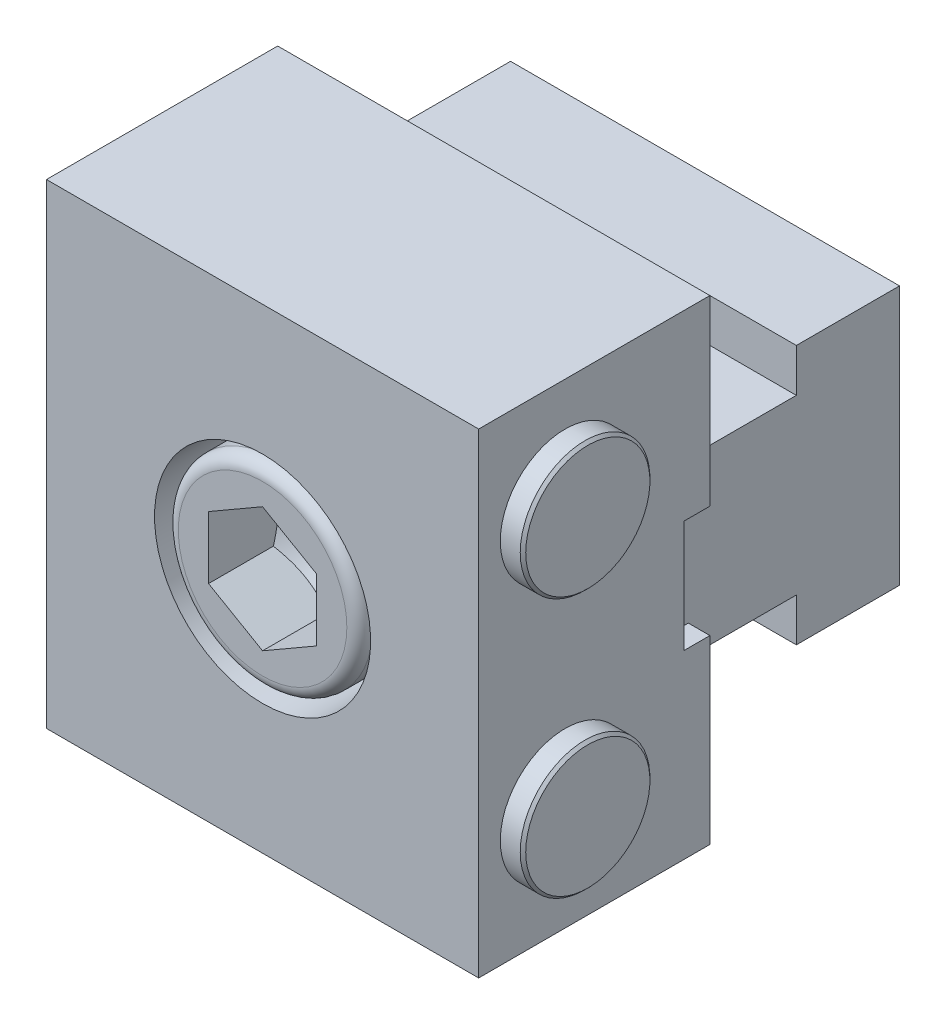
ISO-10303-21;
HEADER;
FILE_DESCRIPTION(('STEP AP214'),'2;1');
FILE_NAME('part.step','',(''),(''),'','','');
FILE_SCHEMA(('AUTOMOTIVE_DESIGN { 1 0 10303 214 1 1 1 1 }'));
ENDSEC;
DATA;
#1=APPLICATION_CONTEXT('core data for automotive mechanical design processes');
#2=APPLICATION_PROTOCOL_DEFINITION('international standard','automotive_design',2000,#1);
#3=PRODUCT_CONTEXT('',#1,'mechanical');
#4=PRODUCT('Part','Part','',(#3));
#5=PRODUCT_RELATED_PRODUCT_CATEGORY('part','',(#4));
#6=PRODUCT_DEFINITION_FORMATION('','',#4);
#7=PRODUCT_DEFINITION_CONTEXT('part definition',#1,'design');
#8=PRODUCT_DEFINITION('design','',#6,#7);
#9=PRODUCT_DEFINITION_SHAPE('','',#8);
#10=(LENGTH_UNIT() NAMED_UNIT(*) SI_UNIT(.MILLI.,.METRE.));
#11=(NAMED_UNIT(*) PLANE_ANGLE_UNIT() SI_UNIT($,.RADIAN.));
#12=(NAMED_UNIT(*) SI_UNIT($,.STERADIAN.) SOLID_ANGLE_UNIT());
#13=UNCERTAINTY_MEASURE_WITH_UNIT(LENGTH_MEASURE(1.E-05),#10,'distance_accuracy_value','');
#14=(GEOMETRIC_REPRESENTATION_CONTEXT(3) GLOBAL_UNCERTAINTY_ASSIGNED_CONTEXT((#13)) GLOBAL_UNIT_ASSIGNED_CONTEXT((#10,
#11,#12)) REPRESENTATION_CONTEXT('',''));
#15=CARTESIAN_POINT('',(0.,0.,0.));
#16=DIRECTION('',(0.,0.,1.));
#17=DIRECTION('',(1.,0.,0.));
#18=AXIS2_PLACEMENT_3D('',#15,#16,#17);
#19=CARTESIAN_POINT('',(0.,0.,-7.7875));
#20=DIRECTION('',(0.,0.,-1.));
#21=DIRECTION('',(-0.5,0.866025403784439,0.));
#22=AXIS2_PLACEMENT_3D('',#19,#20,#21);
#23=CYLINDRICAL_SURFACE('',#22,6.);
#24=CARTESIAN_POINT('',(0.,0.,2.00000000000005));
#25=DIRECTION('',(0.,0.,1.));
#26=DIRECTION('',(0.,1.,0.));
#27=AXIS2_PLACEMENT_3D('',#24,#25,#26);
#28=CIRCLE('',#27,6.);
#29=CARTESIAN_POINT('',(0.,6.,2.00000000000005));
#30=VERTEX_POINT('',#29);
#31=EDGE_CURVE('E422',#30,#30,#28,.T.);
#32=ORIENTED_EDGE('',*,*,#31,.T.);
#33=EDGE_LOOP('',(#32));
#34=FACE_BOUND('',#33,.T.);
#35=CARTESIAN_POINT('',(0.,0.,2.4));
#36=DIRECTION('',(0.,0.,1.));
#37=DIRECTION('',(1.,0.,0.));
#38=AXIS2_PLACEMENT_3D('',#35,#36,#37);
#39=CIRCLE('',#38,6.);
#40=CARTESIAN_POINT('',(6.00000000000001,0.,2.4));
#41=VERTEX_POINT('',#40);
#42=EDGE_CURVE('E392',#41,#41,#39,.F.);
#43=ORIENTED_EDGE('',*,*,#42,.T.);
#44=EDGE_LOOP('',(#43));
#45=FACE_BOUND('',#44,.T.);
#46=ADVANCED_FACE('F15',(#34,#45),#23,.T.);
#47=CARTESIAN_POINT('',(20.,-11.,9.9));
#48=DIRECTION('',(-1.,0.,0.));
#49=DIRECTION('',(0.,0.,1.));
#50=AXIS2_PLACEMENT_3D('',#47,#48,#49);
#51=PLANE('',#50);
#52=DIRECTION('',(0.,0.,1.));
#53=VECTOR('',#52,1.);
#54=CARTESIAN_POINT('',(20.,-22.,-1.6));
#55=LINE('',#54,#53);
#56=CARTESIAN_POINT('',(20.,-22.,0.));
#57=VERTEX_POINT('',#56);
#58=CARTESIAN_POINT('',(20.,-22.,21.4));
#59=VERTEX_POINT('',#58);
#60=EDGE_CURVE('E919',#57,#59,#55,.T.);
#61=ORIENTED_EDGE('',*,*,#60,.F.);
#62=DIRECTION('',(0.,1.,0.));
#63=VECTOR('',#62,1.);
#64=CARTESIAN_POINT('',(20.,-11.,0.));
#65=LINE('',#64,#63);
#66=CARTESIAN_POINT('',(20.,-5.25279616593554,0.));
#67=VERTEX_POINT('',#66);
#68=EDGE_CURVE('E863',#67,#57,#65,.F.);
#69=ORIENTED_EDGE('',*,*,#68,.F.);
#70=DIRECTION('',(0.,0.,1.));
#71=VECTOR('',#70,1.);
#72=CARTESIAN_POINT('',(20.,-5.25279616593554,-42.2716110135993));
#73=LINE('',#72,#71);
#74=CARTESIAN_POINT('',(20.,-5.25279616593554,2.4));
#75=VERTEX_POINT('',#74);
#76=EDGE_CURVE('E282',#67,#75,#73,.T.);
#77=ORIENTED_EDGE('',*,*,#76,.T.);
#78=DIRECTION('',(0.,1.,0.));
#79=VECTOR('',#78,1.);
#80=CARTESIAN_POINT('',(20.,-11.,2.4));
#81=LINE('',#80,#79);
#82=CARTESIAN_POINT('',(20.,5.11810908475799,2.4));
#83=VERTEX_POINT('',#82);
#84=EDGE_CURVE('E858',#83,#75,#81,.F.);
#85=ORIENTED_EDGE('',*,*,#84,.F.);
#86=DIRECTION('',(0.,0.,1.));
#87=VECTOR('',#86,1.);
#88=CARTESIAN_POINT('',(20.,5.11810908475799,-42.2716110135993));
#89=LINE('',#88,#87);
#90=CARTESIAN_POINT('',(20.,5.11810908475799,0.));
#91=VERTEX_POINT('',#90);
#92=EDGE_CURVE('E331',#91,#83,#89,.T.);
#93=ORIENTED_EDGE('',*,*,#92,.F.);
#94=DIRECTION('',(0.,1.,0.));
#95=VECTOR('',#94,1.);
#96=CARTESIAN_POINT('',(20.,-11.,0.));
#97=LINE('',#96,#95);
#98=CARTESIAN_POINT('',(20.,22.,0.));
#99=VERTEX_POINT('',#98);
#100=EDGE_CURVE('E917',#99,#91,#97,.F.);
#101=ORIENTED_EDGE('',*,*,#100,.F.);
#102=DIRECTION('',(0.,0.,1.));
#103=VECTOR('',#102,1.);
#104=CARTESIAN_POINT('',(20.,22.,-1.6));
#105=LINE('',#104,#103);
#106=CARTESIAN_POINT('',(20.,22.,21.4));
#107=VERTEX_POINT('',#106);
#108=EDGE_CURVE('E945',#99,#107,#105,.T.);
#109=ORIENTED_EDGE('',*,*,#108,.T.);
#110=DIRECTION('',(0.,1.,0.));
#111=VECTOR('',#110,1.);
#112=CARTESIAN_POINT('',(20.,-22.,21.4));
#113=LINE('',#112,#111);
#114=EDGE_CURVE('E921',#59,#107,#113,.T.);
#115=ORIENTED_EDGE('',*,*,#114,.F.);
#116=EDGE_LOOP('',(#61,#69,#77,#85,#93,#101,#109,#115));
#117=FACE_BOUND('',#116,.T.);
#118=CARTESIAN_POINT('',(20.,-12.,13.4000000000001));
#119=DIRECTION('',(1.,0.,0.));
#120=DIRECTION('',(0.,0.,-1.));
#121=AXIS2_PLACEMENT_3D('',#118,#119,#120);
#122=CIRCLE('',#121,6.);
#123=CARTESIAN_POINT('',(20.,-12.,7.40000000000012));
#124=VERTEX_POINT('',#123);
#125=EDGE_CURVE('E286',#124,#124,#122,.F.);
#126=ORIENTED_EDGE('',*,*,#125,.T.);
#127=EDGE_LOOP('',(#126));
#128=FACE_BOUND('',#127,.T.);
#129=CARTESIAN_POINT('',(20.,12.,13.4000000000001));
#130=DIRECTION('',(1.,0.,0.));
#131=DIRECTION('',(0.,0.,-1.));
#132=AXIS2_PLACEMENT_3D('',#129,#130,#131);
#133=CIRCLE('',#132,6.);
#134=CARTESIAN_POINT('',(20.,12.,7.40000000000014));
#135=VERTEX_POINT('',#134);
#136=EDGE_CURVE('E295',#135,#135,#133,.F.);
#137=ORIENTED_EDGE('',*,*,#136,.T.);
#138=EDGE_LOOP('',(#137));
#139=FACE_BOUND('',#138,.T.);
#140=ADVANCED_FACE('F614',(#117,#128,#139),#51,.F.);
#141=CARTESIAN_POINT('',(20.,22.,-1.6));
#142=DIRECTION('',(0.,-1.,0.));
#143=DIRECTION('',(0.,0.,1.));
#144=AXIS2_PLACEMENT_3D('',#141,#142,#143);
#145=PLANE('',#144);
#146=DIRECTION('',(0.,0.,1.));
#147=VECTOR('',#146,1.);
#148=CARTESIAN_POINT('',(-20.,22.,9.9));
#149=LINE('',#148,#147);
#150=CARTESIAN_POINT('',(-20.,22.,21.4));
#151=VERTEX_POINT('',#150);
#152=CARTESIAN_POINT('',(-20.,22.,0.));
#153=VERTEX_POINT('',#152);
#154=EDGE_CURVE('E248',#151,#153,#149,.F.);
#155=ORIENTED_EDGE('',*,*,#154,.F.);
#156=DIRECTION('',(-1.,0.,0.));
#157=VECTOR('',#156,1.);
#158=CARTESIAN_POINT('',(20.,22.,21.4));
#159=LINE('',#158,#157);
#160=EDGE_CURVE('E954',#107,#151,#159,.T.);
#161=ORIENTED_EDGE('',*,*,#160,.F.);
#162=ORIENTED_EDGE('',*,*,#108,.F.);
#163=DIRECTION('',(-1.,0.,0.));
#164=VECTOR('',#163,1.);
#165=CARTESIAN_POINT('',(20.,22.,0.));
#166=LINE('',#165,#164);
#167=EDGE_CURVE('E941',#153,#99,#166,.F.);
#168=ORIENTED_EDGE('',*,*,#167,.F.);
#169=EDGE_LOOP('',(#155,#161,#162,#168));
#170=FACE_BOUND('',#169,.T.);
#171=ADVANCED_FACE('F620',(#170),#145,.F.);
#172=CARTESIAN_POINT('',(20.,-22.,21.4));
#173=DIRECTION('',(0.,0.,1.));
#174=DIRECTION('',(0.,1.,0.));
#175=AXIS2_PLACEMENT_3D('',#172,#173,#174);
#176=PLANE('',#175);
#177=DIRECTION('',(0.,1.,0.));
#178=VECTOR('',#177,1.);
#179=CARTESIAN_POINT('',(-20.,-22.,21.4));
#180=LINE('',#179,#178);
#181=CARTESIAN_POINT('',(-20.,-22.,21.4));
#182=VERTEX_POINT('',#181);
#183=EDGE_CURVE('E958',#151,#182,#180,.F.);
#184=ORIENTED_EDGE('',*,*,#183,.T.);
#185=DIRECTION('',(-1.,0.,0.));
#186=VECTOR('',#185,1.);
#187=CARTESIAN_POINT('',(20.,-22.,21.4));
#188=LINE('',#187,#186);
#189=EDGE_CURVE('E779',#182,#59,#188,.F.);
#190=ORIENTED_EDGE('',*,*,#189,.T.);
#191=ORIENTED_EDGE('',*,*,#114,.T.);
#192=ORIENTED_EDGE('',*,*,#160,.T.);
#193=EDGE_LOOP('',(#184,#190,#191,#192));
#194=FACE_BOUND('',#193,.T.);
#195=CARTESIAN_POINT('',(0.,0.,21.4));
#196=DIRECTION('',(0.,0.,1.));
#197=DIRECTION('',(0.,1.,0.));
#198=AXIS2_PLACEMENT_3D('',#195,#196,#197);
#199=CIRCLE('',#198,10.);
#200=CARTESIAN_POINT('',(0.,10.,21.4));
#201=VERTEX_POINT('',#200);
#202=EDGE_CURVE('E771',#201,#201,#199,.F.);
#203=ORIENTED_EDGE('',*,*,#202,.T.);
#204=EDGE_LOOP('',(#203));
#205=FACE_BOUND('',#204,.T.);
#206=ADVANCED_FACE('F976',(#194,#205),#176,.T.);
#207=CARTESIAN_POINT('',(20.,-22.,-1.6));
#208=DIRECTION('',(0.,-1.,0.));
#209=DIRECTION('',(0.,0.,1.));
#210=AXIS2_PLACEMENT_3D('',#207,#208,#209);
#211=PLANE('',#210);
#212=ORIENTED_EDGE('',*,*,#189,.F.);
#213=DIRECTION('',(0.,0.,1.));
#214=VECTOR('',#213,1.);
#215=CARTESIAN_POINT('',(-20.,-22.,-1.6));
#216=LINE('',#215,#214);
#217=CARTESIAN_POINT('',(-20.,-22.,0.));
#218=VERTEX_POINT('',#217);
#219=EDGE_CURVE('E926',#182,#218,#216,.F.);
#220=ORIENTED_EDGE('',*,*,#219,.T.);
#221=DIRECTION('',(-1.,0.,0.));
#222=VECTOR('',#221,1.);
#223=CARTESIAN_POINT('',(20.,-22.,0.));
#224=LINE('',#223,#222);
#225=EDGE_CURVE('E242',#218,#57,#224,.F.);
#226=ORIENTED_EDGE('',*,*,#225,.T.);
#227=ORIENTED_EDGE('',*,*,#60,.T.);
#228=EDGE_LOOP('',(#212,#220,#226,#227));
#229=FACE_BOUND('',#228,.T.);
#230=ADVANCED_FACE('F928',(#229),#211,.T.);
#231=CARTESIAN_POINT('',(20.,22.,0.));
#232=DIRECTION('',(0.,0.,1.));
#233=DIRECTION('',(0.,1.,0.));
#234=AXIS2_PLACEMENT_3D('',#231,#232,#233);
#235=PLANE('',#234);
#236=DIRECTION('',(0.,1.,0.));
#237=VECTOR('',#236,1.);
#238=CARTESIAN_POINT('',(-18.,-5.2846482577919,0.));
#239=LINE('',#238,#237);
#240=CARTESIAN_POINT('',(-18.,-8.,0.));
#241=VERTEX_POINT('',#240);
#242=CARTESIAN_POINT('',(-18.,-5.25279616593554,0.));
#243=VERTEX_POINT('',#242);
#244=EDGE_CURVE('E259',#241,#243,#239,.T.);
#245=ORIENTED_EDGE('',*,*,#244,.F.);
#246=DIRECTION('',(-1.,0.,0.));
#247=VECTOR('',#246,1.);
#248=CARTESIAN_POINT('',(20.,-8.,0.));
#249=LINE('',#248,#247);
#250=CARTESIAN_POINT('',(18.,-8.,0.));
#251=VERTEX_POINT('',#250);
#252=EDGE_CURVE('E856',#251,#241,#249,.T.);
#253=ORIENTED_EDGE('',*,*,#252,.F.);
#254=DIRECTION('',(0.,-1.,0.));
#255=VECTOR('',#254,1.);
#256=CARTESIAN_POINT('',(18.,-5.2846482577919,0.));
#257=LINE('',#256,#255);
#258=CARTESIAN_POINT('',(18.,-5.25279616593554,0.));
#259=VERTEX_POINT('',#258);
#260=EDGE_CURVE('E290',#259,#251,#257,.T.);
#261=ORIENTED_EDGE('',*,*,#260,.F.);
#262=DIRECTION('',(1.,0.,0.));
#263=VECTOR('',#262,1.);
#264=CARTESIAN_POINT('',(20.,-5.25279616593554,0.));
#265=LINE('',#264,#263);
#266=EDGE_CURVE('E260',#259,#67,#265,.T.);
#267=ORIENTED_EDGE('',*,*,#266,.T.);
#268=ORIENTED_EDGE('',*,*,#68,.T.);
#269=ORIENTED_EDGE('',*,*,#225,.F.);
#270=DIRECTION('',(0.,1.,0.));
#271=VECTOR('',#270,1.);
#272=CARTESIAN_POINT('',(-20.,-11.,0.));
#273=LINE('',#272,#271);
#274=CARTESIAN_POINT('',(-20.,-5.25279616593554,0.));
#275=VERTEX_POINT('',#274);
#276=EDGE_CURVE('E239',#275,#218,#273,.F.);
#277=ORIENTED_EDGE('',*,*,#276,.F.);
#278=DIRECTION('',(1.,0.,0.));
#279=VECTOR('',#278,1.);
#280=CARTESIAN_POINT('',(-20.,-5.25279616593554,0.));
#281=LINE('',#280,#279);
#282=EDGE_CURVE('E31',#275,#243,#281,.T.);
#283=ORIENTED_EDGE('',*,*,#282,.T.);
#284=EDGE_LOOP('',(#245,#253,#261,#267,#268,#269,#277,#283));
#285=FACE_BOUND('',#284,.T.);
#286=ADVANCED_FACE('F240',(#285),#235,.F.);
#287=CARTESIAN_POINT('',(20.,-8.,-1.6));
#288=DIRECTION('',(0.,-1.,0.));
#289=DIRECTION('',(0.,0.,1.));
#290=AXIS2_PLACEMENT_3D('',#287,#288,#289);
#291=PLANE('',#290);
#292=DIRECTION('',(-1.,0.,0.));
#293=VECTOR('',#292,1.);
#294=CARTESIAN_POINT('',(20.,-8.,2.00000000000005));
#295=LINE('',#294,#293);
#296=CARTESIAN_POINT('',(10.9433253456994,-8.,2.00000000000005));
#297=VERTEX_POINT('',#296);
#298=CARTESIAN_POINT('',(-11.2126995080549,-8.,2.00000000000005));
#299=VERTEX_POINT('',#298);
#300=EDGE_CURVE('E763',#297,#299,#295,.T.);
#301=ORIENTED_EDGE('',*,*,#300,.T.);
#302=DIRECTION('',(0.,0.,1.));
#303=VECTOR('',#302,1.);
#304=CARTESIAN_POINT('',(-11.2126995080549,-8.,-1.6));
#305=LINE('',#304,#303);
#306=CARTESIAN_POINT('',(-11.2126995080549,-8.,2.4));
#307=VERTEX_POINT('',#306);
#308=EDGE_CURVE('E319',#299,#307,#305,.T.);
#309=ORIENTED_EDGE('',*,*,#308,.T.);
#310=DIRECTION('',(-1.,0.,0.));
#311=VECTOR('',#310,1.);
#312=CARTESIAN_POINT('',(20.,-8.,2.4));
#313=LINE('',#312,#311);
#314=CARTESIAN_POINT('',(10.9433253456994,-8.,2.4));
#315=VERTEX_POINT('',#314);
#316=EDGE_CURVE('E765',#315,#307,#313,.T.);
#317=ORIENTED_EDGE('',*,*,#316,.F.);
#318=DIRECTION('',(0.,0.,-1.));
#319=VECTOR('',#318,1.);
#320=CARTESIAN_POINT('',(10.9433253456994,-8.,-1.6));
#321=LINE('',#320,#319);
#322=EDGE_CURVE('E311',#315,#297,#321,.T.);
#323=ORIENTED_EDGE('',*,*,#322,.T.);
#324=EDGE_LOOP('',(#301,#309,#317,#323));
#325=FACE_BOUND('',#324,.T.);
#326=ADVANCED_FACE('F762',(#325),#291,.F.);
#327=CARTESIAN_POINT('',(20.,-8.,2.4));
#328=DIRECTION('',(0.,0.,1.));
#329=DIRECTION('',(0.,1.,0.));
#330=AXIS2_PLACEMENT_3D('',#327,#328,#329);
#331=PLANE('',#330);
#332=DIRECTION('',(0.,1.,0.));
#333=VECTOR('',#332,1.);
#334=CARTESIAN_POINT('',(-11.2126995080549,-8.,2.4));
#335=LINE('',#334,#333);
#336=CARTESIAN_POINT('',(-11.2126995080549,-5.25279616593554,2.4));
#337=VERTEX_POINT('',#336);
#338=EDGE_CURVE('E323',#307,#337,#335,.T.);
#339=ORIENTED_EDGE('',*,*,#338,.T.);
#340=DIRECTION('',(-1.,0.,0.));
#341=VECTOR('',#340,1.);
#342=CARTESIAN_POINT('',(20.,-5.25279616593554,2.4));
#343=LINE('',#342,#341);
#344=CARTESIAN_POINT('',(-20.,-5.25279616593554,2.4));
#345=VERTEX_POINT('',#344);
#346=EDGE_CURVE('E308',#337,#345,#343,.T.);
#347=ORIENTED_EDGE('',*,*,#346,.T.);
#348=DIRECTION('',(0.,1.,0.));
#349=VECTOR('',#348,1.);
#350=CARTESIAN_POINT('',(-20.,-11.,2.4));
#351=LINE('',#350,#349);
#352=CARTESIAN_POINT('',(-20.,5.11810908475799,2.4));
#353=VERTEX_POINT('',#352);
#354=EDGE_CURVE('E249',#353,#345,#351,.F.);
#355=ORIENTED_EDGE('',*,*,#354,.F.);
#356=DIRECTION('',(1.,0.,0.));
#357=VECTOR('',#356,1.);
#358=CARTESIAN_POINT('',(20.,5.11810908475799,2.4));
#359=LINE('',#358,#357);
#360=CARTESIAN_POINT('',(-11.2126995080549,5.11810908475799,2.4));
#361=VERTEX_POINT('',#360);
#362=EDGE_CURVE('E374',#353,#361,#359,.T.);
#363=ORIENTED_EDGE('',*,*,#362,.T.);
#364=DIRECTION('',(0.,1.,0.));
#365=VECTOR('',#364,1.);
#366=CARTESIAN_POINT('',(-11.2126995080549,-8.,2.4));
#367=LINE('',#366,#365);
#368=CARTESIAN_POINT('',(-11.2126995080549,8.,2.4));
#369=VERTEX_POINT('',#368);
#370=EDGE_CURVE('E381',#361,#369,#367,.T.);
#371=ORIENTED_EDGE('',*,*,#370,.T.);
#372=DIRECTION('',(-1.,0.,0.));
#373=VECTOR('',#372,1.);
#374=CARTESIAN_POINT('',(20.,8.,2.4));
#375=LINE('',#374,#373);
#376=CARTESIAN_POINT('',(10.9433253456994,8.,2.4));
#377=VERTEX_POINT('',#376);
#378=EDGE_CURVE('E865',#377,#369,#375,.T.);
#379=ORIENTED_EDGE('',*,*,#378,.F.);
#380=DIRECTION('',(0.,-1.,0.));
#381=VECTOR('',#380,1.);
#382=CARTESIAN_POINT('',(10.9433253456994,-8.,2.4));
#383=LINE('',#382,#381);
#384=CARTESIAN_POINT('',(10.9433253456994,5.11810908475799,2.4));
#385=VERTEX_POINT('',#384);
#386=EDGE_CURVE('E388',#377,#385,#383,.T.);
#387=ORIENTED_EDGE('',*,*,#386,.T.);
#388=DIRECTION('',(1.,0.,0.));
#389=VECTOR('',#388,1.);
#390=CARTESIAN_POINT('',(20.,5.11810908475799,2.4));
#391=LINE('',#390,#389);
#392=EDGE_CURVE('E367',#385,#83,#391,.T.);
#393=ORIENTED_EDGE('',*,*,#392,.T.);
#394=ORIENTED_EDGE('',*,*,#84,.T.);
#395=DIRECTION('',(-1.,0.,0.));
#396=VECTOR('',#395,1.);
#397=CARTESIAN_POINT('',(20.,-5.25279616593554,2.4));
#398=LINE('',#397,#396);
#399=CARTESIAN_POINT('',(10.9433253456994,-5.25279616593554,2.4));
#400=VERTEX_POINT('',#399);
#401=EDGE_CURVE('E301',#75,#400,#398,.T.);
#402=ORIENTED_EDGE('',*,*,#401,.T.);
#403=DIRECTION('',(0.,-1.,0.));
#404=VECTOR('',#403,1.);
#405=CARTESIAN_POINT('',(10.9433253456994,-8.,2.4));
#406=LINE('',#405,#404);
#407=EDGE_CURVE('E315',#400,#315,#406,.T.);
#408=ORIENTED_EDGE('',*,*,#407,.T.);
#409=ORIENTED_EDGE('',*,*,#316,.T.);
#410=EDGE_LOOP('',(#339,#347,#355,#363,#371,#379,#387,#393,#394,#402,#408,#409));
#411=FACE_BOUND('',#410,.T.);
#412=ORIENTED_EDGE('',*,*,#42,.F.);
#413=EDGE_LOOP('',(#412));
#414=FACE_BOUND('',#413,.T.);
#415=ADVANCED_FACE('F882',(#411,#414),#331,.F.);
#416=CARTESIAN_POINT('',(20.,8.,-1.6));
#417=DIRECTION('',(0.,-1.,0.));
#418=DIRECTION('',(0.,0.,1.));
#419=AXIS2_PLACEMENT_3D('',#416,#417,#418);
#420=PLANE('',#419);
#421=DIRECTION('',(0.,0.,-1.));
#422=VECTOR('',#421,1.);
#423=CARTESIAN_POINT('',(10.9433253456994,8.,-1.6));
#424=LINE('',#423,#422);
#425=CARTESIAN_POINT('',(10.9433253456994,8.,2.00000000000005));
#426=VERTEX_POINT('',#425);
#427=EDGE_CURVE('E385',#377,#426,#424,.T.);
#428=ORIENTED_EDGE('',*,*,#427,.F.);
#429=ORIENTED_EDGE('',*,*,#378,.T.);
#430=DIRECTION('',(0.,0.,1.));
#431=VECTOR('',#430,1.);
#432=CARTESIAN_POINT('',(-11.2126995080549,8.,-1.6));
#433=LINE('',#432,#431);
#434=CARTESIAN_POINT('',(-11.2126995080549,8.,2.00000000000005));
#435=VERTEX_POINT('',#434);
#436=EDGE_CURVE('E378',#435,#369,#433,.T.);
#437=ORIENTED_EDGE('',*,*,#436,.F.);
#438=DIRECTION('',(-1.,0.,0.));
#439=VECTOR('',#438,1.);
#440=CARTESIAN_POINT('',(20.,8.,2.00000000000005));
#441=LINE('',#440,#439);
#442=EDGE_CURVE('E770',#426,#435,#441,.T.);
#443=ORIENTED_EDGE('',*,*,#442,.F.);
#444=EDGE_LOOP('',(#428,#429,#437,#443));
#445=FACE_BOUND('',#444,.T.);
#446=ADVANCED_FACE('F879',(#445),#420,.T.);
#447=CARTESIAN_POINT('',(20.,22.,0.));
#448=DIRECTION('',(0.,0.,1.));
#449=DIRECTION('',(0.,1.,0.));
#450=AXIS2_PLACEMENT_3D('',#447,#448,#449);
#451=PLANE('',#450);
#452=DIRECTION('',(-1.,0.,0.));
#453=VECTOR('',#452,1.);
#454=CARTESIAN_POINT('',(-20.,5.11810908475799,0.));
#455=LINE('',#454,#453);
#456=CARTESIAN_POINT('',(-18.,5.11810908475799,0.));
#457=VERTEX_POINT('',#456);
#458=CARTESIAN_POINT('',(-20.,5.11810908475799,0.));
#459=VERTEX_POINT('',#458);
#460=EDGE_CURVE('E330',#457,#459,#455,.T.);
#461=ORIENTED_EDGE('',*,*,#460,.T.);
#462=DIRECTION('',(0.,1.,0.));
#463=VECTOR('',#462,1.);
#464=CARTESIAN_POINT('',(-20.,-11.,0.));
#465=LINE('',#464,#463);
#466=EDGE_CURVE('E938',#153,#459,#465,.F.);
#467=ORIENTED_EDGE('',*,*,#466,.F.);
#468=ORIENTED_EDGE('',*,*,#167,.T.);
#469=ORIENTED_EDGE('',*,*,#100,.T.);
#470=DIRECTION('',(-1.,0.,0.));
#471=VECTOR('',#470,1.);
#472=CARTESIAN_POINT('',(20.,5.11810908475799,0.));
#473=LINE('',#472,#471);
#474=CARTESIAN_POINT('',(18.,5.11810908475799,0.));
#475=VERTEX_POINT('',#474);
#476=EDGE_CURVE('E39',#91,#475,#473,.T.);
#477=ORIENTED_EDGE('',*,*,#476,.T.);
#478=DIRECTION('',(0.,-1.,0.));
#479=VECTOR('',#478,1.);
#480=CARTESIAN_POINT('',(18.,-5.2846482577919,0.));
#481=LINE('',#480,#479);
#482=CARTESIAN_POINT('',(18.,8.,0.));
#483=VERTEX_POINT('',#482);
#484=EDGE_CURVE('E360',#483,#475,#481,.T.);
#485=ORIENTED_EDGE('',*,*,#484,.F.);
#486=DIRECTION('',(-1.,0.,0.));
#487=VECTOR('',#486,1.);
#488=CARTESIAN_POINT('',(20.,8.,0.));
#489=LINE('',#488,#487);
#490=CARTESIAN_POINT('',(-18.,8.,0.));
#491=VERTEX_POINT('',#490);
#492=EDGE_CURVE('E703',#491,#483,#489,.F.);
#493=ORIENTED_EDGE('',*,*,#492,.F.);
#494=DIRECTION('',(0.,1.,0.));
#495=VECTOR('',#494,1.);
#496=CARTESIAN_POINT('',(-18.,-5.2846482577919,0.));
#497=LINE('',#496,#495);
#498=EDGE_CURVE('E347',#457,#491,#497,.T.);
#499=ORIENTED_EDGE('',*,*,#498,.F.);
#500=EDGE_LOOP('',(#461,#467,#468,#469,#477,#485,#493,#499));
#501=FACE_BOUND('',#500,.T.);
#502=ADVANCED_FACE('F656',(#501),#451,.F.);
#503=CARTESIAN_POINT('',(-20.,-11.,9.9));
#504=DIRECTION('',(-1.,0.,0.));
#505=DIRECTION('',(0.,0.,1.));
#506=AXIS2_PLACEMENT_3D('',#503,#504,#505);
#507=PLANE('',#506);
#508=DIRECTION('',(0.,0.,1.));
#509=VECTOR('',#508,1.);
#510=CARTESIAN_POINT('',(-20.,-5.25279616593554,-42.2716110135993));
#511=LINE('',#510,#509);
#512=EDGE_CURVE('E253',#275,#345,#511,.T.);
#513=ORIENTED_EDGE('',*,*,#512,.F.);
#514=ORIENTED_EDGE('',*,*,#276,.T.);
#515=ORIENTED_EDGE('',*,*,#219,.F.);
#516=ORIENTED_EDGE('',*,*,#183,.F.);
#517=ORIENTED_EDGE('',*,*,#154,.T.);
#518=ORIENTED_EDGE('',*,*,#466,.T.);
#519=DIRECTION('',(0.,0.,1.));
#520=VECTOR('',#519,1.);
#521=CARTESIAN_POINT('',(-20.,5.11810908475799,-42.2716110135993));
#522=LINE('',#521,#520);
#523=EDGE_CURVE('E327',#459,#353,#522,.T.);
#524=ORIENTED_EDGE('',*,*,#523,.T.);
#525=ORIENTED_EDGE('',*,*,#354,.T.);
#526=EDGE_LOOP('',(#513,#514,#515,#516,#517,#518,#524,#525));
#527=FACE_BOUND('',#526,.T.);
#528=CARTESIAN_POINT('',(-20.,-12.,13.4000000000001));
#529=DIRECTION('',(-1.,0.,0.));
#530=DIRECTION('',(0.,0.,1.));
#531=AXIS2_PLACEMENT_3D('',#528,#529,#530);
#532=CIRCLE('',#531,6.);
#533=CARTESIAN_POINT('',(-20.,-12.,19.4000000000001));
#534=VERTEX_POINT('',#533);
#535=EDGE_CURVE('E291',#534,#534,#532,.F.);
#536=ORIENTED_EDGE('',*,*,#535,.T.);
#537=EDGE_LOOP('',(#536));
#538=FACE_BOUND('',#537,.T.);
#539=CARTESIAN_POINT('',(-20.,12.,13.4000000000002));
#540=DIRECTION('',(-1.,0.,0.));
#541=DIRECTION('',(0.,0.,1.));
#542=AXIS2_PLACEMENT_3D('',#539,#540,#541);
#543=CIRCLE('',#542,6.);
#544=CARTESIAN_POINT('',(-20.,12.,19.4000000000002));
#545=VERTEX_POINT('',#544);
#546=EDGE_CURVE('E348',#545,#545,#543,.F.);
#547=ORIENTED_EDGE('',*,*,#546,.T.);
#548=EDGE_LOOP('',(#547));
#549=FACE_BOUND('',#548,.T.);
#550=ADVANCED_FACE('F263',(#527,#538,#549),#507,.T.);
#551=CARTESIAN_POINT('',(0.,0.,15.4));
#552=DIRECTION('',(0.,0.,1.));
#553=DIRECTION('',(0.,1.,0.));
#554=AXIS2_PLACEMENT_3D('',#551,#552,#553);
#555=CYLINDRICAL_SURFACE('',#554,10.);
#556=CARTESIAN_POINT('',(0.,0.,9.4));
#557=DIRECTION('',(0.,0.,1.));
#558=DIRECTION('',(0.,1.,0.));
#559=AXIS2_PLACEMENT_3D('',#556,#557,#558);
#560=CIRCLE('',#559,10.);
#561=CARTESIAN_POINT('',(0.,10.,9.4));
#562=VERTEX_POINT('',#561);
#563=EDGE_CURVE('E782',#562,#562,#560,.T.);
#564=ORIENTED_EDGE('',*,*,#563,.F.);
#565=EDGE_LOOP('',(#564));
#566=FACE_BOUND('',#565,.T.);
#567=ORIENTED_EDGE('',*,*,#202,.F.);
#568=EDGE_LOOP('',(#567));
#569=FACE_BOUND('',#568,.T.);
#570=ADVANCED_FACE('F689',(#566,#569),#555,.F.);
#571=CARTESIAN_POINT('',(18.,-8.,-10.));
#572=DIRECTION('',(0.,-1.,0.));
#573=DIRECTION('',(0.,0.,1.));
#574=AXIS2_PLACEMENT_3D('',#571,#572,#573);
#575=PLANE('',#574);
#576=ORIENTED_EDGE('',*,*,#252,.T.);
#577=DIRECTION('',(0.,0.,1.));
#578=VECTOR('',#577,1.);
#579=CARTESIAN_POINT('',(-18.,-8.,-9.49031612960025));
#580=LINE('',#579,#578);
#581=CARTESIAN_POINT('',(-18.,-8.,-10.));
#582=VERTEX_POINT('',#581);
#583=EDGE_CURVE('E715',#582,#241,#580,.T.);
#584=ORIENTED_EDGE('',*,*,#583,.F.);
#585=DIRECTION('',(-1.,0.,0.));
#586=VECTOR('',#585,1.);
#587=CARTESIAN_POINT('',(18.,-8.,-10.));
#588=LINE('',#587,#586);
#589=CARTESIAN_POINT('',(18.,-8.,-10.));
#590=VERTEX_POINT('',#589);
#591=EDGE_CURVE('E726',#590,#582,#588,.T.);
#592=ORIENTED_EDGE('',*,*,#591,.F.);
#593=DIRECTION('',(0.,0.,-1.));
#594=VECTOR('',#593,1.);
#595=CARTESIAN_POINT('',(18.,-8.,-9.49031612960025));
#596=LINE('',#595,#594);
#597=EDGE_CURVE('E820',#251,#590,#596,.T.);
#598=ORIENTED_EDGE('',*,*,#597,.F.);
#599=EDGE_LOOP('',(#576,#584,#592,#598));
#600=FACE_BOUND('',#599,.T.);
#601=ADVANCED_FACE('F681',(#600),#575,.T.);
#602=CARTESIAN_POINT('',(18.,-8.,2.00000000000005));
#603=DIRECTION('',(0.,0.,1.));
#604=DIRECTION('',(0.,1.,0.));
#605=AXIS2_PLACEMENT_3D('',#602,#603,#604);
#606=PLANE('',#605);
#607=DIRECTION('',(-1.,0.,0.));
#608=VECTOR('',#607,1.);
#609=CARTESIAN_POINT('',(18.,-5.25279616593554,2.00000000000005));
#610=LINE('',#609,#608);
#611=CARTESIAN_POINT('',(-11.2126995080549,-5.25279616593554,2.00000000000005));
#612=VERTEX_POINT('',#611);
#613=CARTESIAN_POINT('',(-18.,-5.25279616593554,2.00000000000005));
#614=VERTEX_POINT('',#613);
#615=EDGE_CURVE('E305',#612,#614,#610,.T.);
#616=ORIENTED_EDGE('',*,*,#615,.F.);
#617=DIRECTION('',(0.,1.,0.));
#618=VECTOR('',#617,1.);
#619=CARTESIAN_POINT('',(-11.2126995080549,-8.,2.00000000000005));
#620=LINE('',#619,#618);
#621=EDGE_CURVE('E9',#299,#612,#620,.T.);
#622=ORIENTED_EDGE('',*,*,#621,.F.);
#623=ORIENTED_EDGE('',*,*,#300,.F.);
#624=DIRECTION('',(0.,-1.,0.));
#625=VECTOR('',#624,1.);
#626=CARTESIAN_POINT('',(10.9433253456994,-8.,2.00000000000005));
#627=LINE('',#626,#625);
#628=CARTESIAN_POINT('',(10.9433253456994,-5.25279616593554,2.00000000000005));
#629=VERTEX_POINT('',#628);
#630=EDGE_CURVE('E24',#629,#297,#627,.T.);
#631=ORIENTED_EDGE('',*,*,#630,.F.);
#632=DIRECTION('',(-1.,0.,0.));
#633=VECTOR('',#632,1.);
#634=CARTESIAN_POINT('',(18.,-5.25279616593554,2.00000000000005));
#635=LINE('',#634,#633);
#636=CARTESIAN_POINT('',(18.,-5.25279616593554,2.00000000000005));
#637=VERTEX_POINT('',#636);
#638=EDGE_CURVE('E298',#637,#629,#635,.T.);
#639=ORIENTED_EDGE('',*,*,#638,.F.);
#640=DIRECTION('',(0.,1.,0.));
#641=VECTOR('',#640,1.);
#642=CARTESIAN_POINT('',(18.,-5.2846482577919,2.00000000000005));
#643=LINE('',#642,#641);
#644=CARTESIAN_POINT('',(18.,5.11810908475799,2.00000000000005));
#645=VERTEX_POINT('',#644);
#646=EDGE_CURVE('E823',#645,#637,#643,.F.);
#647=ORIENTED_EDGE('',*,*,#646,.F.);
#648=DIRECTION('',(1.,0.,0.));
#649=VECTOR('',#648,1.);
#650=CARTESIAN_POINT('',(18.,5.11810908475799,2.00000000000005));
#651=LINE('',#650,#649);
#652=CARTESIAN_POINT('',(10.9433253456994,5.11810908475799,2.00000000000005));
#653=VERTEX_POINT('',#652);
#654=EDGE_CURVE('E364',#653,#645,#651,.T.);
#655=ORIENTED_EDGE('',*,*,#654,.F.);
#656=DIRECTION('',(0.,-1.,0.));
#657=VECTOR('',#656,1.);
#658=CARTESIAN_POINT('',(10.9433253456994,-8.,2.00000000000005));
#659=LINE('',#658,#657);
#660=EDGE_CURVE('E357',#426,#653,#659,.T.);
#661=ORIENTED_EDGE('',*,*,#660,.F.);
#662=ORIENTED_EDGE('',*,*,#442,.T.);
#663=DIRECTION('',(0.,1.,0.));
#664=VECTOR('',#663,1.);
#665=CARTESIAN_POINT('',(-11.2126995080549,-8.,2.00000000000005));
#666=LINE('',#665,#664);
#667=CARTESIAN_POINT('',(-11.2126995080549,5.11810908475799,2.00000000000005));
#668=VERTEX_POINT('',#667);
#669=EDGE_CURVE('E741',#668,#435,#666,.T.);
#670=ORIENTED_EDGE('',*,*,#669,.F.);
#671=DIRECTION('',(1.,0.,0.));
#672=VECTOR('',#671,1.);
#673=CARTESIAN_POINT('',(18.,5.11810908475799,2.00000000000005));
#674=LINE('',#673,#672);
#675=CARTESIAN_POINT('',(-18.,5.11810908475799,2.00000000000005));
#676=VERTEX_POINT('',#675);
#677=EDGE_CURVE('E371',#676,#668,#674,.T.);
#678=ORIENTED_EDGE('',*,*,#677,.F.);
#679=DIRECTION('',(0.,1.,0.));
#680=VECTOR('',#679,1.);
#681=CARTESIAN_POINT('',(-18.,-5.2846482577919,2.00000000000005));
#682=LINE('',#681,#680);
#683=EDGE_CURVE('E709',#614,#676,#682,.T.);
#684=ORIENTED_EDGE('',*,*,#683,.F.);
#685=EDGE_LOOP('',(#616,#622,#623,#631,#639,#647,#655,#661,#662,#670,#678,#684));
#686=FACE_BOUND('',#685,.T.);
#687=ORIENTED_EDGE('',*,*,#31,.F.);
#688=EDGE_LOOP('',(#687));
#689=FACE_BOUND('',#688,.T.);
#690=ADVANCED_FACE('F677',(#686,#689),#606,.T.);
#691=CARTESIAN_POINT('',(-18.,-5.2846482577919,-9.49031612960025));
#692=DIRECTION('',(-1.,0.,0.));
#693=DIRECTION('',(0.,0.,1.));
#694=AXIS2_PLACEMENT_3D('',#691,#692,#693);
#695=PLANE('',#694);
#696=DIRECTION('',(0.,0.,-1.));
#697=VECTOR('',#696,1.);
#698=CARTESIAN_POINT('',(-18.,-5.25279616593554,-9.49031612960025));
#699=LINE('',#698,#697);
#700=EDGE_CURVE('E256',#614,#243,#699,.T.);
#701=ORIENTED_EDGE('',*,*,#700,.F.);
#702=ORIENTED_EDGE('',*,*,#683,.T.);
#703=DIRECTION('',(0.,0.,1.));
#704=VECTOR('',#703,1.);
#705=CARTESIAN_POINT('',(-18.,5.11810908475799,-9.49031612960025));
#706=LINE('',#705,#704);
#707=EDGE_CURVE('E737',#457,#676,#706,.T.);
#708=ORIENTED_EDGE('',*,*,#707,.F.);
#709=ORIENTED_EDGE('',*,*,#498,.T.);
#710=DIRECTION('',(0.,0.,1.));
#711=VECTOR('',#710,1.);
#712=CARTESIAN_POINT('',(-18.,8.,-9.49031612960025));
#713=LINE('',#712,#711);
#714=CARTESIAN_POINT('',(-18.,8.,-10.));
#715=VERTEX_POINT('',#714);
#716=EDGE_CURVE('E700',#491,#715,#713,.F.);
#717=ORIENTED_EDGE('',*,*,#716,.T.);
#718=DIRECTION('',(0.,1.,0.));
#719=VECTOR('',#718,1.);
#720=CARTESIAN_POINT('',(-18.,-5.2846482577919,-10.));
#721=LINE('',#720,#719);
#722=CARTESIAN_POINT('',(-18.,12.,-10.));
#723=VERTEX_POINT('',#722);
#724=EDGE_CURVE('E708',#715,#723,#721,.T.);
#725=ORIENTED_EDGE('',*,*,#724,.T.);
#726=DIRECTION('',(0.,0.,1.));
#727=VECTOR('',#726,1.);
#728=CARTESIAN_POINT('',(-18.,12.,-19.5499287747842));
#729=LINE('',#728,#727);
#730=CARTESIAN_POINT('',(-18.,12.,-19.5499287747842));
#731=VERTEX_POINT('',#730);
#732=EDGE_CURVE('E839',#723,#731,#729,.F.);
#733=ORIENTED_EDGE('',*,*,#732,.T.);
#734=DIRECTION('',(0.,-1.,0.));
#735=VECTOR('',#734,1.);
#736=CARTESIAN_POINT('',(-18.,0.,-19.5499287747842));
#737=LINE('',#736,#735);
#738=CARTESIAN_POINT('',(-18.,-12.,-19.5499287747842));
#739=VERTEX_POINT('',#738);
#740=EDGE_CURVE('E801',#739,#731,#737,.F.);
#741=ORIENTED_EDGE('',*,*,#740,.F.);
#742=DIRECTION('',(0.,0.,1.));
#743=VECTOR('',#742,1.);
#744=CARTESIAN_POINT('',(-18.,-12.,-19.5499287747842));
#745=LINE('',#744,#743);
#746=CARTESIAN_POINT('',(-18.,-12.,-10.));
#747=VERTEX_POINT('',#746);
#748=EDGE_CURVE('E805',#747,#739,#745,.F.);
#749=ORIENTED_EDGE('',*,*,#748,.F.);
#750=DIRECTION('',(0.,1.,0.));
#751=VECTOR('',#750,1.);
#752=CARTESIAN_POINT('',(-18.,-5.2846482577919,-10.));
#753=LINE('',#752,#751);
#754=EDGE_CURVE('E722',#747,#582,#753,.T.);
#755=ORIENTED_EDGE('',*,*,#754,.T.);
#756=ORIENTED_EDGE('',*,*,#583,.T.);
#757=ORIENTED_EDGE('',*,*,#244,.T.);
#758=EDGE_LOOP('',(#701,#702,#708,#709,#717,#725,#733,#741,#749,#755,#756,#757));
#759=FACE_BOUND('',#758,.T.);
#760=ADVANCED_FACE('F670',(#759),#695,.T.);
#761=CARTESIAN_POINT('',(18.,-5.2846482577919,-9.49031612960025));
#762=DIRECTION('',(1.,0.,0.));
#763=DIRECTION('',(0.,0.,-1.));
#764=AXIS2_PLACEMENT_3D('',#761,#762,#763);
#765=PLANE('',#764);
#766=DIRECTION('',(0.,0.,1.));
#767=VECTOR('',#766,1.);
#768=CARTESIAN_POINT('',(18.,-5.25279616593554,-9.49031612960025));
#769=LINE('',#768,#767);
#770=EDGE_CURVE('E748',#259,#637,#769,.T.);
#771=ORIENTED_EDGE('',*,*,#770,.F.);
#772=ORIENTED_EDGE('',*,*,#260,.T.);
#773=ORIENTED_EDGE('',*,*,#597,.T.);
#774=DIRECTION('',(0.,1.,0.));
#775=VECTOR('',#774,1.);
#776=CARTESIAN_POINT('',(18.,-5.2846482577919,-10.));
#777=LINE('',#776,#775);
#778=CARTESIAN_POINT('',(18.,-12.,-10.));
#779=VERTEX_POINT('',#778);
#780=EDGE_CURVE('E817',#590,#779,#777,.F.);
#781=ORIENTED_EDGE('',*,*,#780,.T.);
#782=DIRECTION('',(0.,0.,1.));
#783=VECTOR('',#782,1.);
#784=CARTESIAN_POINT('',(18.,-12.,-19.5499287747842));
#785=LINE('',#784,#783);
#786=CARTESIAN_POINT('',(18.,-12.,-19.5499287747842));
#787=VERTEX_POINT('',#786);
#788=EDGE_CURVE('E813',#787,#779,#785,.T.);
#789=ORIENTED_EDGE('',*,*,#788,.F.);
#790=DIRECTION('',(0.,-1.,0.));
#791=VECTOR('',#790,1.);
#792=CARTESIAN_POINT('',(18.,0.,-19.5499287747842));
#793=LINE('',#792,#791);
#794=CARTESIAN_POINT('',(18.,12.,-19.5499287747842));
#795=VERTEX_POINT('',#794);
#796=EDGE_CURVE('E793',#795,#787,#793,.T.);
#797=ORIENTED_EDGE('',*,*,#796,.F.);
#798=DIRECTION('',(0.,0.,-1.));
#799=VECTOR('',#798,1.);
#800=CARTESIAN_POINT('',(18.,12.,-9.49031612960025));
#801=LINE('',#800,#799);
#802=CARTESIAN_POINT('',(18.,12.,-10.));
#803=VERTEX_POINT('',#802);
#804=EDGE_CURVE('E835',#795,#803,#801,.F.);
#805=ORIENTED_EDGE('',*,*,#804,.T.);
#806=DIRECTION('',(0.,1.,0.));
#807=VECTOR('',#806,1.);
#808=CARTESIAN_POINT('',(18.,-5.2846482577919,-10.));
#809=LINE('',#808,#807);
#810=CARTESIAN_POINT('',(18.,8.,-10.));
#811=VERTEX_POINT('',#810);
#812=EDGE_CURVE('E831',#803,#811,#809,.F.);
#813=ORIENTED_EDGE('',*,*,#812,.T.);
#814=DIRECTION('',(0.,0.,-1.));
#815=VECTOR('',#814,1.);
#816=CARTESIAN_POINT('',(18.,8.,-9.49031612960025));
#817=LINE('',#816,#815);
#818=EDGE_CURVE('E827',#811,#483,#817,.F.);
#819=ORIENTED_EDGE('',*,*,#818,.T.);
#820=ORIENTED_EDGE('',*,*,#484,.T.);
#821=DIRECTION('',(0.,0.,-1.));
#822=VECTOR('',#821,1.);
#823=CARTESIAN_POINT('',(18.,5.11810908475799,-9.49031612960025));
#824=LINE('',#823,#822);
#825=EDGE_CURVE('E352',#645,#475,#824,.T.);
#826=ORIENTED_EDGE('',*,*,#825,.F.);
#827=ORIENTED_EDGE('',*,*,#646,.T.);
#828=EDGE_LOOP('',(#771,#772,#773,#781,#789,#797,#805,#813,#819,#820,#826,#827));
#829=FACE_BOUND('',#828,.T.);
#830=ADVANCED_FACE('F666',(#829),#765,.T.);
#831=CARTESIAN_POINT('',(18.,8.,-10.));
#832=DIRECTION('',(0.,-1.,0.));
#833=DIRECTION('',(0.,0.,1.));
#834=AXIS2_PLACEMENT_3D('',#831,#832,#833);
#835=PLANE('',#834);
#836=ORIENTED_EDGE('',*,*,#716,.F.);
#837=ORIENTED_EDGE('',*,*,#492,.T.);
#838=ORIENTED_EDGE('',*,*,#818,.F.);
#839=DIRECTION('',(-1.,0.,0.));
#840=VECTOR('',#839,1.);
#841=CARTESIAN_POINT('',(18.,8.,-10.));
#842=LINE('',#841,#840);
#843=EDGE_CURVE('E704',#715,#811,#842,.F.);
#844=ORIENTED_EDGE('',*,*,#843,.F.);
#845=EDGE_LOOP('',(#836,#837,#838,#844));
#846=FACE_BOUND('',#845,.T.);
#847=ADVANCED_FACE('F669',(#846),#835,.F.);
#848=CARTESIAN_POINT('',(0.,0.,9.4));
#849=DIRECTION('',(0.,0.,1.));
#850=DIRECTION('',(0.,1.,0.));
#851=AXIS2_PLACEMENT_3D('',#848,#849,#850);
#852=PLANE('',#851);
#853=CARTESIAN_POINT('',(0.,0.,9.4));
#854=DIRECTION('',(0.,0.,-1.));
#855=DIRECTION('',(-0.5,0.866025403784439,0.));
#856=AXIS2_PLACEMENT_3D('',#853,#854,#855);
#857=CIRCLE('',#856,9.);
#858=CARTESIAN_POINT('',(-4.49999999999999,7.79422863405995,9.4));
#859=VERTEX_POINT('',#858);
#860=EDGE_CURVE('E434',#859,#859,#857,.T.);
#861=ORIENTED_EDGE('',*,*,#860,.T.);
#862=EDGE_LOOP('',(#861));
#863=FACE_BOUND('',#862,.T.);
#864=ORIENTED_EDGE('',*,*,#563,.T.);
#865=EDGE_LOOP('',(#864));
#866=FACE_BOUND('',#865,.T.);
#867=ADVANCED_FACE('F686',(#863,#866),#852,.T.);
#868=CARTESIAN_POINT('',(18.,-12.,-10.));
#869=DIRECTION('',(0.,0.,1.));
#870=DIRECTION('',(0.,1.,0.));
#871=AXIS2_PLACEMENT_3D('',#868,#869,#870);
#872=PLANE('',#871);
#873=ORIENTED_EDGE('',*,*,#754,.F.);
#874=DIRECTION('',(-1.,0.,0.));
#875=VECTOR('',#874,1.);
#876=CARTESIAN_POINT('',(18.,-12.,-10.));
#877=LINE('',#876,#875);
#878=EDGE_CURVE('E809',#779,#747,#877,.T.);
#879=ORIENTED_EDGE('',*,*,#878,.F.);
#880=ORIENTED_EDGE('',*,*,#780,.F.);
#881=ORIENTED_EDGE('',*,*,#591,.T.);
#882=EDGE_LOOP('',(#873,#879,#880,#881));
#883=FACE_BOUND('',#882,.T.);
#884=ADVANCED_FACE('F683',(#883),#872,.T.);
#885=CARTESIAN_POINT('',(18.,12.,-10.));
#886=DIRECTION('',(0.,0.,-1.));
#887=DIRECTION('',(0.,-1.,0.));
#888=AXIS2_PLACEMENT_3D('',#885,#886,#887);
#889=PLANE('',#888);
#890=DIRECTION('',(-1.,0.,0.));
#891=VECTOR('',#890,1.);
#892=CARTESIAN_POINT('',(18.,12.,-10.));
#893=LINE('',#892,#891);
#894=EDGE_CURVE('E713',#803,#723,#893,.T.);
#895=ORIENTED_EDGE('',*,*,#894,.T.);
#896=ORIENTED_EDGE('',*,*,#724,.F.);
#897=ORIENTED_EDGE('',*,*,#843,.T.);
#898=ORIENTED_EDGE('',*,*,#812,.F.);
#899=EDGE_LOOP('',(#895,#896,#897,#898));
#900=FACE_BOUND('',#899,.T.);
#901=ADVANCED_FACE('F17',(#900),#889,.F.);
#902=CARTESIAN_POINT('',(18.,12.,-19.5499287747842));
#903=DIRECTION('',(0.,-1.,0.));
#904=DIRECTION('',(0.,0.,1.));
#905=AXIS2_PLACEMENT_3D('',#902,#903,#904);
#906=PLANE('',#905);
#907=DIRECTION('',(-1.,0.,0.));
#908=VECTOR('',#907,1.);
#909=CARTESIAN_POINT('',(18.,12.,-19.5499287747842));
#910=LINE('',#909,#908);
#911=EDGE_CURVE('E797',#731,#795,#910,.F.);
#912=ORIENTED_EDGE('',*,*,#911,.F.);
#913=ORIENTED_EDGE('',*,*,#732,.F.);
#914=ORIENTED_EDGE('',*,*,#894,.F.);
#915=ORIENTED_EDGE('',*,*,#804,.F.);
#916=EDGE_LOOP('',(#912,#913,#914,#915));
#917=FACE_BOUND('',#916,.T.);
#918=ADVANCED_FACE('F661',(#917),#906,.F.);
#919=CARTESIAN_POINT('',(18.,0.,-19.5499287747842));
#920=DIRECTION('',(0.,0.,-1.));
#921=DIRECTION('',(0.,-1.,0.));
#922=AXIS2_PLACEMENT_3D('',#919,#920,#921);
#923=PLANE('',#922);
#924=CARTESIAN_POINT('',(0.,0.,-19.5499287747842));
#925=DIRECTION('',(0.,0.,1.));
#926=DIRECTION('',(0.,1.,0.));
#927=AXIS2_PLACEMENT_3D('',#924,#925,#926);
#928=CIRCLE('',#927,6.);
#929=CARTESIAN_POINT('',(0.,6.,-19.5499287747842));
#930=VERTEX_POINT('',#929);
#931=EDGE_CURVE('E731',#930,#930,#928,.T.);
#932=ORIENTED_EDGE('',*,*,#931,.T.);
#933=EDGE_LOOP('',(#932));
#934=FACE_BOUND('',#933,.T.);
#935=ORIENTED_EDGE('',*,*,#796,.T.);
#936=DIRECTION('',(-1.,0.,0.));
#937=VECTOR('',#936,1.);
#938=CARTESIAN_POINT('',(18.,-12.,-19.5499287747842));
#939=LINE('',#938,#937);
#940=EDGE_CURVE('E789',#787,#739,#939,.T.);
#941=ORIENTED_EDGE('',*,*,#940,.T.);
#942=ORIENTED_EDGE('',*,*,#740,.T.);
#943=ORIENTED_EDGE('',*,*,#911,.T.);
#944=EDGE_LOOP('',(#935,#941,#942,#943));
#945=FACE_BOUND('',#944,.T.);
#946=ADVANCED_FACE('F658',(#934,#945),#923,.T.);
#947=CARTESIAN_POINT('',(18.,-12.,-19.5499287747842));
#948=DIRECTION('',(0.,-1.,0.));
#949=DIRECTION('',(0.,0.,1.));
#950=AXIS2_PLACEMENT_3D('',#947,#948,#949);
#951=PLANE('',#950);
#952=ORIENTED_EDGE('',*,*,#748,.T.);
#953=ORIENTED_EDGE('',*,*,#940,.F.);
#954=ORIENTED_EDGE('',*,*,#788,.T.);
#955=ORIENTED_EDGE('',*,*,#878,.T.);
#956=EDGE_LOOP('',(#952,#953,#954,#955));
#957=FACE_BOUND('',#956,.T.);
#958=ADVANCED_FACE('F651',(#957),#951,.T.);
#959=CARTESIAN_POINT('',(0.,0.,15.4));
#960=DIRECTION('',(0.,0.,-1.));
#961=DIRECTION('',(-0.5,0.866025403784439,0.));
#962=AXIS2_PLACEMENT_3D('',#959,#960,#961);
#963=CYLINDRICAL_SURFACE('',#962,9.);
#964=CARTESIAN_POINT('',(0.,0.,20.2));
#965=DIRECTION('',(0.,0.,-1.));
#966=DIRECTION('',(-0.5,0.866025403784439,0.));
#967=AXIS2_PLACEMENT_3D('',#964,#965,#966);
#968=CIRCLE('',#967,9.);
#969=CARTESIAN_POINT('',(-4.49999999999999,7.79422863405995,20.2));
#970=VERTEX_POINT('',#969);
#971=EDGE_CURVE('E430',#970,#970,#968,.T.);
#972=ORIENTED_EDGE('',*,*,#971,.T.);
#973=EDGE_LOOP('',(#972));
#974=FACE_BOUND('',#973,.T.);
#975=ORIENTED_EDGE('',*,*,#860,.F.);
#976=EDGE_LOOP('',(#975));
#977=FACE_BOUND('',#976,.T.);
#978=ADVANCED_FACE('F451',(#974,#977),#963,.T.);
#979=CARTESIAN_POINT('',(0.,0.,-19.5499287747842));
#980=DIRECTION('',(0.,0.,1.));
#981=DIRECTION('',(0.,1.,0.));
#982=AXIS2_PLACEMENT_3D('',#979,#980,#981);
#983=CYLINDRICAL_SURFACE('',#982,6.);
#984=ORIENTED_EDGE('',*,*,#931,.F.);
#985=EDGE_LOOP('',(#984));
#986=FACE_BOUND('',#985,.T.);
#987=CARTESIAN_POINT('',(0.,0.,-19.5264625));
#988=DIRECTION('',(0.,0.,-1.));
#989=DIRECTION('',(-0.5,0.866025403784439,0.));
#990=AXIS2_PLACEMENT_3D('',#987,#988,#989);
#991=CIRCLE('',#990,6.);
#992=CARTESIAN_POINT('',(-3.,5.19615242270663,-19.5264625));
#993=VERTEX_POINT('',#992);
#994=EDGE_CURVE('E423',#993,#993,#991,.F.);
#995=ORIENTED_EDGE('',*,*,#994,.T.);
#996=EDGE_LOOP('',(#995));
#997=FACE_BOUND('',#996,.T.);
#998=ADVANCED_FACE('F449',(#986,#997),#983,.F.);
#999=CARTESIAN_POINT('',(0.,0.,20.2));
#1000=DIRECTION('',(0.,0.,-1.));
#1001=DIRECTION('',(-0.866025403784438,-0.5,0.));
#1002=AXIS2_PLACEMENT_3D('',#999,#1000,#1001);
#1003=TOROIDAL_SURFACE('',#1002,7.8,1.2);
#1004=ORIENTED_EDGE('',*,*,#971,.F.);
#1005=EDGE_LOOP('',(#1004));
#1006=FACE_BOUND('',#1005,.T.);
#1007=CARTESIAN_POINT('',(0.,0.,21.4));
#1008=DIRECTION('',(0.,0.,-1.));
#1009=DIRECTION('',(-0.500000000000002,0.866025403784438,0.));
#1010=AXIS2_PLACEMENT_3D('',#1007,#1008,#1009);
#1011=CIRCLE('',#1010,7.8);
#1012=CARTESIAN_POINT('',(-3.9,6.75499814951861,21.4));
#1013=VERTEX_POINT('',#1012);
#1014=EDGE_CURVE('E435',#1013,#1013,#1011,.T.);
#1015=ORIENTED_EDGE('',*,*,#1014,.T.);
#1016=EDGE_LOOP('',(#1015));
#1017=FACE_BOUND('',#1016,.T.);
#1018=ADVANCED_FACE('F443',(#1006,#1017),#1003,.T.);
#1019=CARTESIAN_POINT('',(0.,0.,-19.5264625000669));
#1020=DIRECTION('',(0.,0.,1.));
#1021=DIRECTION('',(0.866025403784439,0.5,0.));
#1022=AXIS2_PLACEMENT_3D('',#1019,#1020,#1021);
#1023=CONICAL_SURFACE('',#1022,5.99999999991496,0.785398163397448);
#1024=CARTESIAN_POINT('',(0.,0.,-20.6000000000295));
#1025=DIRECTION('',(0.,0.,1.));
#1026=DIRECTION('',(0.866025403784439,0.5,0.));
#1027=AXIS2_PLACEMENT_3D('',#1024,#1025,#1026);
#1028=CIRCLE('',#1027,4.92646249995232);
#1029=CARTESIAN_POINT('',(4.26644167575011,2.46323124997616,-20.6000000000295));
#1030=VERTEX_POINT('',#1029);
#1031=EDGE_CURVE('E427',#1030,#1030,#1028,.T.);
#1032=ORIENTED_EDGE('',*,*,#1031,.T.);
#1033=EDGE_LOOP('',(#1032));
#1034=FACE_BOUND('',#1033,.T.);
#1035=ORIENTED_EDGE('',*,*,#994,.F.);
#1036=EDGE_LOOP('',(#1035));
#1037=FACE_BOUND('',#1036,.T.);
#1038=ADVANCED_FACE('F448',(#1034,#1037),#1023,.T.);
#1039=CARTESIAN_POINT('',(-3.69337567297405,6.39711431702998,21.4));
#1040=DIRECTION('',(0.,0.,1.));
#1041=DIRECTION('',(0.5,-0.866025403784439,0.));
#1042=AXIS2_PLACEMENT_3D('',#1039,#1040,#1041);
#1043=PLANE('',#1042);
#1044=DIRECTION('',(-0.866025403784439,0.5,0.));
#1045=VECTOR('',#1044,1.);
#1046=CARTESIAN_POINT('',(0.,-5.77350269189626,21.4));
#1047=LINE('',#1046,#1045);
#1048=CARTESIAN_POINT('',(0.,-5.77350269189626,21.4));
#1049=VERTEX_POINT('',#1048);
#1050=CARTESIAN_POINT('',(-5.,-2.88675134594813,21.4));
#1051=VERTEX_POINT('',#1050);
#1052=EDGE_CURVE('E515',#1049,#1051,#1047,.T.);
#1053=ORIENTED_EDGE('',*,*,#1052,.T.);
#1054=DIRECTION('',(0.,1.,0.));
#1055=VECTOR('',#1054,1.);
#1056=CARTESIAN_POINT('',(-5.,-2.88675134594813,21.4));
#1057=LINE('',#1056,#1055);
#1058=CARTESIAN_POINT('',(-5.,2.88675134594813,21.4));
#1059=VERTEX_POINT('',#1058);
#1060=EDGE_CURVE('E511',#1051,#1059,#1057,.T.);
#1061=ORIENTED_EDGE('',*,*,#1060,.T.);
#1062=DIRECTION('',(0.866025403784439,0.5,0.));
#1063=VECTOR('',#1062,1.);
#1064=CARTESIAN_POINT('',(-2.5,4.3301270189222,21.4));
#1065=LINE('',#1064,#1063);
#1066=CARTESIAN_POINT('',(0.,5.77350269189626,21.4));
#1067=VERTEX_POINT('',#1066);
#1068=EDGE_CURVE('E504',#1059,#1067,#1065,.T.);
#1069=ORIENTED_EDGE('',*,*,#1068,.T.);
#1070=DIRECTION('',(0.86602540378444,-0.5,0.));
#1071=VECTOR('',#1070,1.);
#1072=CARTESIAN_POINT('',(0.,5.77350269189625,21.4));
#1073=LINE('',#1072,#1071);
#1074=CARTESIAN_POINT('',(5.,2.88675134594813,21.4));
#1075=VERTEX_POINT('',#1074);
#1076=EDGE_CURVE('E508',#1067,#1075,#1073,.T.);
#1077=ORIENTED_EDGE('',*,*,#1076,.T.);
#1078=DIRECTION('',(0.,-1.,0.));
#1079=VECTOR('',#1078,1.);
#1080=CARTESIAN_POINT('',(5.,2.88675134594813,21.4));
#1081=LINE('',#1080,#1079);
#1082=CARTESIAN_POINT('',(5.,-2.88675134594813,21.4));
#1083=VERTEX_POINT('',#1082);
#1084=EDGE_CURVE('E527',#1075,#1083,#1081,.T.);
#1085=ORIENTED_EDGE('',*,*,#1084,.T.);
#1086=DIRECTION('',(0.866025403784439,0.5,0.));
#1087=VECTOR('',#1086,1.);
#1088=CARTESIAN_POINT('',(2.5,-4.3301270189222,21.4));
#1089=LINE('',#1088,#1087);
#1090=EDGE_CURVE('E521',#1083,#1049,#1089,.F.);
#1091=ORIENTED_EDGE('',*,*,#1090,.T.);
#1092=EDGE_LOOP('',(#1053,#1061,#1069,#1077,#1085,#1091));
#1093=FACE_BOUND('',#1092,.T.);
#1094=ORIENTED_EDGE('',*,*,#1014,.F.);
#1095=EDGE_LOOP('',(#1094));
#1096=FACE_BOUND('',#1095,.T.);
#1097=ADVANCED_FACE('F453',(#1093,#1096),#1043,.T.);
#1098=CARTESIAN_POINT('',(-1.5,2.59807621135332,-20.6));
#1099=DIRECTION('',(0.,0.,-1.));
#1100=DIRECTION('',(-0.5,0.866025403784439,0.));
#1101=AXIS2_PLACEMENT_3D('',#1098,#1099,#1100);
#1102=PLANE('',#1101);
#1103=ORIENTED_EDGE('',*,*,#1031,.F.);
#1104=EDGE_LOOP('',(#1103));
#1105=FACE_BOUND('',#1104,.T.);
#1106=ADVANCED_FACE('F631',(#1105),#1102,.T.);
#1107=CARTESIAN_POINT('',(-5.,-2.88675134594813,21.4));
#1108=DIRECTION('',(-0.5,-0.866025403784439,0.));
#1109=DIRECTION('',(-0.866025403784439,0.5,0.));
#1110=AXIS2_PLACEMENT_3D('',#1107,#1108,#1109);
#1111=PLANE('',#1110);
#1112=DIRECTION('',(0.,0.,-1.));
#1113=VECTOR('',#1112,1.);
#1114=CARTESIAN_POINT('',(-5.,-2.88675134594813,21.4));
#1115=LINE('',#1114,#1113);
#1116=CARTESIAN_POINT('',(-5.00000000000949,-2.88675134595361,15.399999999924));
#1117=VERTEX_POINT('',#1116);
#1118=EDGE_CURVE('E472',#1117,#1051,#1115,.F.);
#1119=ORIENTED_EDGE('',*,*,#1118,.T.);
#1120=ORIENTED_EDGE('',*,*,#1052,.F.);
#1121=DIRECTION('',(0.,0.,-1.));
#1122=VECTOR('',#1121,1.);
#1123=CARTESIAN_POINT('',(0.,-5.77350269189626,21.4));
#1124=LINE('',#1123,#1122);
#1125=CARTESIAN_POINT('',(0.,-5.77350269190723,15.399999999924));
#1126=VERTEX_POINT('',#1125);
#1127=EDGE_CURVE('E480',#1126,#1049,#1124,.F.);
#1128=ORIENTED_EDGE('',*,*,#1127,.F.);
#1129=CARTESIAN_POINT('',(-5.00000000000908,-2.88675134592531,15.3999999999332));
#1130=CARTESIAN_POINT('',(-4.78026878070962,-3.0136132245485,15.3267433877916));
#1131=CARTESIAN_POINT('',(-4.55865818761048,-3.14156016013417,15.2601139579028));
#1132=CARTESIAN_POINT('',(-4.11159990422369,-3.39966938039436,15.1438136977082));
#1133=CARTESIAN_POINT('',(-3.8861442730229,-3.5298362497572,15.0941840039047));
#1134=CARTESIAN_POINT('',(-3.43799264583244,-3.78857671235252,15.0169443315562));
#1135=CARTESIAN_POINT('',(-3.21536642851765,-3.91711001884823,14.9888198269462));
#1136=CARTESIAN_POINT('',(-2.88064429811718,-4.11036193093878,14.9636032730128));
#1137=CARTESIAN_POINT('',(-2.76899393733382,-4.17482329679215,14.9580247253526));
#1138=CARTESIAN_POINT('',(-2.54559014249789,-4.30380553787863,14.9526191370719));
#1139=CARTESIAN_POINT('',(-2.43383671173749,-4.36832641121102,14.9527919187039));
#1140=CARTESIAN_POINT('',(-2.12768962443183,-4.54508051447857,14.9611797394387));
#1141=CARTESIAN_POINT('',(-1.93339749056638,-4.65725513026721,14.975256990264));
#1142=CARTESIAN_POINT('',(-1.54610267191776,-4.88085989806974,15.0198894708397));
#1143=CARTESIAN_POINT('',(-1.35310134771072,-4.99228926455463,15.0504599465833));
#1144=CARTESIAN_POINT('',(-0.96502670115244,-5.21634426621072,15.1268756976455));
#1145=CARTESIAN_POINT('',(-0.770002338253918,-5.32894163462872,15.1730446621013));
#1146=CARTESIAN_POINT('',(-0.382861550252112,-5.55245747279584,15.2778288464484));
#1147=CARTESIAN_POINT('',(-0.190740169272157,-5.6633788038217,15.3364194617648));
#1148=CARTESIAN_POINT('',(1.6906181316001E-11,-5.77350269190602,15.3999999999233));
#1149=B_SPLINE_CURVE_WITH_KNOTS('',3,(#1129,#1130,#1131,#1132,#1133,#1134,#1135,#1136,#1137,
#1138,#1139,#1140,#1141,#1142,#1143,#1144,#1145,#1146,#1147,#1148),.UNSPECIFIED.,.F.,.F.,(4,2,2,
2,2,2,2,2,2,4),(0.,0.792540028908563,1.58698454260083,2.36176901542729,2.7487873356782,
3.13579369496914,3.80946092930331,4.48375195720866,5.17299552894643,5.86088640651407),.UNSPECIFIED.);
#1150=EDGE_CURVE('E477',#1117,#1126,#1149,.T.);
#1151=ORIENTED_EDGE('',*,*,#1150,.F.);
#1152=EDGE_LOOP('',(#1119,#1120,#1128,#1151));
#1153=FACE_BOUND('',#1152,.T.);
#1154=ADVANCED_FACE('F633',(#1153),#1111,.F.);
#1155=CARTESIAN_POINT('',(-5.,2.88675134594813,21.4));
#1156=DIRECTION('',(-1.,0.,0.));
#1157=DIRECTION('',(0.,1.,0.));
#1158=AXIS2_PLACEMENT_3D('',#1155,#1156,#1157);
#1159=PLANE('',#1158);
#1160=DIRECTION('',(0.,0.,-1.));
#1161=VECTOR('',#1160,1.);
#1162=CARTESIAN_POINT('',(-5.,2.88675134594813,21.4));
#1163=LINE('',#1162,#1161);
#1164=CARTESIAN_POINT('',(-5.00000000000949,2.88675134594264,15.3999999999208));
#1165=VERTEX_POINT('',#1164);
#1166=EDGE_CURVE('E462',#1059,#1165,#1163,.T.);
#1167=ORIENTED_EDGE('',*,*,#1166,.F.);
#1168=ORIENTED_EDGE('',*,*,#1060,.F.);
#1169=ORIENTED_EDGE('',*,*,#1118,.F.);
#1170=CARTESIAN_POINT('',(-4.99999999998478,2.88675134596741,15.3999999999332));
#1171=CARTESIAN_POINT('',(-4.99999999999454,2.63302758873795,15.3267433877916));
#1172=CARTESIAN_POINT('',(-4.99999999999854,2.37713371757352,15.2601139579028));
#1173=CARTESIAN_POINT('',(-5.00000000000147,1.86091527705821,15.1438136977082));
#1174=CARTESIAN_POINT('',(-5.00000000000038,1.60058153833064,15.0941840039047));
#1175=CARTESIAN_POINT('',(-4.99999999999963,1.08310061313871,15.0169443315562));
#1176=CARTESIAN_POINT('',(-4.99999999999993,0.826034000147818,14.9888198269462));
#1177=CARTESIAN_POINT('',(-5.00000000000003,0.439530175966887,14.9636032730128));
#1178=CARTESIAN_POINT('',(-5.00000000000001,0.310607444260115,14.9580247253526));
#1179=CARTESIAN_POINT('',(-4.99999999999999,0.0526429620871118,14.9526191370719));
#1180=CARTESIAN_POINT('',(-5.,-0.0763987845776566,14.9527919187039));
#1181=CARTESIAN_POINT('',(-5.00000000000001,-0.429906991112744,14.9611797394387));
#1182=CARTESIAN_POINT('',(-5.,-0.654256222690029,14.975256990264));
#1183=CARTESIAN_POINT('',(-5.,-1.10146575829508,15.0198894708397));
#1184=CARTESIAN_POINT('',(-5.,-1.32432449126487,15.0504599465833));
#1185=CARTESIAN_POINT('',(-5.,-1.77243449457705,15.1268756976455));
#1186=CARTESIAN_POINT('',(-5.,-1.99762923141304,15.1730446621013));
#1187=CARTESIAN_POINT('',(-5.,-2.44466090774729,15.2778288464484));
#1188=CARTESIAN_POINT('',(-5.,-2.66650356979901,15.3364194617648));
#1189=CARTESIAN_POINT('',(-5.,-2.88675134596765,15.3999999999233));
#1190=B_SPLINE_CURVE_WITH_KNOTS('',3,(#1170,#1171,#1172,#1173,#1174,#1175,#1176,#1177,#1178,
#1179,#1180,#1181,#1182,#1183,#1184,#1185,#1186,#1187,#1188,#1189),.UNSPECIFIED.,.F.,.F.,(4,2,2,
2,2,2,2,2,2,4),(0.,0.792540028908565,1.58698454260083,2.36176901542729,2.74878733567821,
3.13579369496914,3.80946092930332,4.48375195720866,5.17299552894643,5.86088640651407),.UNSPECIFIED.);
#1191=EDGE_CURVE('E471',#1165,#1117,#1190,.T.);
#1192=ORIENTED_EDGE('',*,*,#1191,.F.);
#1193=EDGE_LOOP('',(#1167,#1168,#1169,#1192));
#1194=FACE_BOUND('',#1193,.T.);
#1195=ADVANCED_FACE('F560',(#1194),#1159,.F.);
#1196=CARTESIAN_POINT('',(0.,5.77350269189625,21.4));
#1197=DIRECTION('',(-0.5,0.866025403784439,0.));
#1198=DIRECTION('',(0.866025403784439,0.5,0.));
#1199=AXIS2_PLACEMENT_3D('',#1196,#1197,#1198);
#1200=PLANE('',#1199);
#1201=DIRECTION('',(0.,0.,-1.));
#1202=VECTOR('',#1201,1.);
#1203=CARTESIAN_POINT('',(0.,5.77350269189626,21.4));
#1204=LINE('',#1203,#1202);
#1205=CARTESIAN_POINT('',(0.,5.77350269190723,15.399999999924));
#1206=VERTEX_POINT('',#1205);
#1207=EDGE_CURVE('E498',#1206,#1067,#1204,.F.);
#1208=ORIENTED_EDGE('',*,*,#1207,.T.);
#1209=ORIENTED_EDGE('',*,*,#1068,.F.);
#1210=ORIENTED_EDGE('',*,*,#1166,.T.);
#1211=CARTESIAN_POINT('',(2.4309547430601E-11,5.77350269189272,15.3999999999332));
#1212=CARTESIAN_POINT('',(-0.219731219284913,5.64664081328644,15.3267433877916));
#1213=CARTESIAN_POINT('',(-0.441341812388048,5.51869387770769,15.2601139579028));
#1214=CARTESIAN_POINT('',(-0.888400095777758,5.26058465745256,15.1438136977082));
#1215=CARTESIAN_POINT('',(-1.11385572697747,5.13041778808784,15.0941840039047));
#1216=CARTESIAN_POINT('',(-1.56200735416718,4.87167732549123,15.0169443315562));
#1217=CARTESIAN_POINT('',(-1.78463357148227,4.74314401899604,14.9888198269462));
#1218=CARTESIAN_POINT('',(-2.11935570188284,4.54989210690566,14.9636032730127));
#1219=CARTESIAN_POINT('',(-2.23100606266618,4.48543074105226,14.9580247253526));
#1220=CARTESIAN_POINT('',(-2.45440985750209,4.35644849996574,14.9526191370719));
#1221=CARTESIAN_POINT('',(-2.56616328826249,4.29192762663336,14.9527919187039));
#1222=CARTESIAN_POINT('',(-2.87231037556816,4.11517352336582,14.9611797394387));
#1223=CARTESIAN_POINT('',(-3.06660250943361,4.00299890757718,14.975256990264));
#1224=CARTESIAN_POINT('',(-3.45389732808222,3.77939413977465,15.0198894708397));
#1225=CARTESIAN_POINT('',(-3.64689865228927,3.66796477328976,15.0504599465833));
#1226=CARTESIAN_POINT('',(-4.03497329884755,3.44390977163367,15.1268756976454));
#1227=CARTESIAN_POINT('',(-4.22999766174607,3.33131240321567,15.1730446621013));
#1228=CARTESIAN_POINT('',(-4.61713844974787,3.10779656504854,15.2778288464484));
#1229=CARTESIAN_POINT('',(-4.80925983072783,2.99687523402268,15.3364194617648));
#1230=CARTESIAN_POINT('',(-5.00000000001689,2.88675134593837,15.3999999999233));
#1231=B_SPLINE_CURVE_WITH_KNOTS('',3,(#1211,#1212,#1213,#1214,#1215,#1216,#1217,#1218,#1219,
#1220,#1221,#1222,#1223,#1224,#1225,#1226,#1227,#1228,#1229,#1230),.UNSPECIFIED.,.F.,.F.,(4,2,2,
2,2,2,2,2,2,4),(0.,0.792540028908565,1.58698454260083,2.36176901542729,2.74878733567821,
3.13579369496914,3.80946092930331,4.48375195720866,5.17299552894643,5.86088640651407),.UNSPECIFIED.);
#1232=EDGE_CURVE('E501',#1206,#1165,#1231,.T.);
#1233=ORIENTED_EDGE('',*,*,#1232,.F.);
#1234=EDGE_LOOP('',(#1208,#1209,#1210,#1233));
#1235=FACE_BOUND('',#1234,.T.);
#1236=ADVANCED_FACE('F570',(#1235),#1200,.F.);
#1237=CARTESIAN_POINT('',(5.,2.88675134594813,21.4));
#1238=DIRECTION('',(0.5,0.866025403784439,0.));
#1239=DIRECTION('',(0.866025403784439,-0.5,0.));
#1240=AXIS2_PLACEMENT_3D('',#1237,#1238,#1239);
#1241=PLANE('',#1240);
#1242=DIRECTION('',(0.,0.,-1.));
#1243=VECTOR('',#1242,1.);
#1244=CARTESIAN_POINT('',(5.,2.88675134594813,21.4));
#1245=LINE('',#1244,#1243);
#1246=CARTESIAN_POINT('',(5.00000000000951,2.88675134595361,15.399999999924));
#1247=VERTEX_POINT('',#1246);
#1248=EDGE_CURVE('E492',#1247,#1075,#1245,.F.);
#1249=ORIENTED_EDGE('',*,*,#1248,.T.);
#1250=ORIENTED_EDGE('',*,*,#1076,.F.);
#1251=ORIENTED_EDGE('',*,*,#1207,.F.);
#1252=CARTESIAN_POINT('',(5.0000000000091,2.88675134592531,15.3999999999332));
#1253=CARTESIAN_POINT('',(4.78026878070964,3.01361322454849,15.3267433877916));
#1254=CARTESIAN_POINT('',(4.55865818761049,3.14156016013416,15.2601139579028));
#1255=CARTESIAN_POINT('',(4.1115999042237,3.39966938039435,15.1438136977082));
#1256=CARTESIAN_POINT('',(3.88614427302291,3.52983624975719,15.0941840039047));
#1257=CARTESIAN_POINT('',(3.43799264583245,3.78857671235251,15.0169443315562));
#1258=CARTESIAN_POINT('',(3.21536642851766,3.91711001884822,14.9888198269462));
#1259=CARTESIAN_POINT('',(2.88064429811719,4.11036193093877,14.9636032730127));
#1260=CARTESIAN_POINT('',(2.76899393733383,4.17482329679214,14.9580247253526));
#1261=CARTESIAN_POINT('',(2.5455901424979,4.30380553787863,14.9526191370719));
#1262=CARTESIAN_POINT('',(2.4338367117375,4.36832641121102,14.9527919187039));
#1263=CARTESIAN_POINT('',(2.12768962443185,4.54508051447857,14.9611797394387));
#1264=CARTESIAN_POINT('',(1.93339749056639,4.65725513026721,14.975256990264));
#1265=CARTESIAN_POINT('',(1.54610267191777,4.88085989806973,15.0198894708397));
#1266=CARTESIAN_POINT('',(1.35310134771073,4.99228926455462,15.0504599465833));
#1267=CARTESIAN_POINT('',(0.965026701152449,5.21634426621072,15.1268756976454));
#1268=CARTESIAN_POINT('',(0.770002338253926,5.32894163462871,15.1730446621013));
#1269=CARTESIAN_POINT('',(0.38286155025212,5.55245747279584,15.2778288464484));
#1270=CARTESIAN_POINT('',(0.190740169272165,5.6633788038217,15.3364194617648));
#1271=CARTESIAN_POINT('',(-1.68953392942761E-11,5.77350269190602,15.3999999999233));
#1272=B_SPLINE_CURVE_WITH_KNOTS('',3,(#1252,#1253,#1254,#1255,#1256,#1257,#1258,#1259,#1260,
#1261,#1262,#1263,#1264,#1265,#1266,#1267,#1268,#1269,#1270,#1271),.UNSPECIFIED.,.F.,.F.,(4,2,2,
2,2,2,2,2,2,4),(0.,0.792540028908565,1.58698454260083,2.36176901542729,2.74878733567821,
3.13579369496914,3.80946092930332,4.48375195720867,5.17299552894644,5.86088640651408),.UNSPECIFIED.);
#1273=EDGE_CURVE('E495',#1247,#1206,#1272,.T.);
#1274=ORIENTED_EDGE('',*,*,#1273,.F.);
#1275=EDGE_LOOP('',(#1249,#1250,#1251,#1274));
#1276=FACE_BOUND('',#1275,.T.);
#1277=ADVANCED_FACE('F602',(#1276),#1241,.F.);
#1278=CARTESIAN_POINT('',(5.,-2.88675134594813,21.4));
#1279=DIRECTION('',(1.,0.,0.));
#1280=DIRECTION('',(0.,-1.,0.));
#1281=AXIS2_PLACEMENT_3D('',#1278,#1279,#1280);
#1282=PLANE('',#1281);
#1283=DIRECTION('',(0.,0.,-1.));
#1284=VECTOR('',#1283,1.);
#1285=CARTESIAN_POINT('',(5.,-2.88675134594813,21.4));
#1286=LINE('',#1285,#1284);
#1287=CARTESIAN_POINT('',(5.00000000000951,-2.88675134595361,15.399999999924));
#1288=VERTEX_POINT('',#1287);
#1289=EDGE_CURVE('E486',#1288,#1083,#1286,.F.);
#1290=ORIENTED_EDGE('',*,*,#1289,.T.);
#1291=ORIENTED_EDGE('',*,*,#1084,.F.);
#1292=ORIENTED_EDGE('',*,*,#1248,.F.);
#1293=CARTESIAN_POINT('',(4.9999999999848,-2.88675134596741,15.3999999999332));
#1294=CARTESIAN_POINT('',(4.99999999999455,-2.63302758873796,15.3267433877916));
#1295=CARTESIAN_POINT('',(4.99999999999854,-2.37713371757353,15.2601139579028));
#1296=CARTESIAN_POINT('',(5.00000000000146,-1.86091527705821,15.1438136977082));
#1297=CARTESIAN_POINT('',(5.00000000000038,-1.60058153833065,15.0941840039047));
#1298=CARTESIAN_POINT('',(4.99999999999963,-1.08310061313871,15.0169443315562));
#1299=CARTESIAN_POINT('',(4.99999999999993,-0.82603400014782,14.9888198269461));
#1300=CARTESIAN_POINT('',(5.00000000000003,-0.439530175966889,14.9636032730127));
#1301=CARTESIAN_POINT('',(5.00000000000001,-0.310607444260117,14.9580247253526));
#1302=CARTESIAN_POINT('',(4.99999999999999,-0.0526429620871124,14.9526191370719));
#1303=CARTESIAN_POINT('',(5.,0.0763987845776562,14.9527919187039));
#1304=CARTESIAN_POINT('',(5.00000000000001,0.429906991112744,14.9611797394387));
#1305=CARTESIAN_POINT('',(5.,0.65425622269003,14.975256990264));
#1306=CARTESIAN_POINT('',(5.,1.10146575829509,15.0198894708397));
#1307=CARTESIAN_POINT('',(5.,1.32432449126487,15.0504599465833));
#1308=CARTESIAN_POINT('',(5.,1.77243449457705,15.1268756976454));
#1309=CARTESIAN_POINT('',(5.,1.99762923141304,15.1730446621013));
#1310=CARTESIAN_POINT('',(5.,2.4446609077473,15.2778288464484));
#1311=CARTESIAN_POINT('',(5.,2.66650356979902,15.3364194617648));
#1312=CARTESIAN_POINT('',(5.,2.88675134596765,15.3999999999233));
#1313=B_SPLINE_CURVE_WITH_KNOTS('',3,(#1293,#1294,#1295,#1296,#1297,#1298,#1299,#1300,#1301,
#1302,#1303,#1304,#1305,#1306,#1307,#1308,#1309,#1310,#1311,#1312),.UNSPECIFIED.,.F.,.F.,(4,2,2,
2,2,2,2,2,2,4),(0.,0.792540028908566,1.58698454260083,2.36176901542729,2.74878733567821,
3.13579369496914,3.80946092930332,4.48375195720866,5.17299552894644,5.86088640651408),.UNSPECIFIED.);
#1314=EDGE_CURVE('E489',#1288,#1247,#1313,.T.);
#1315=ORIENTED_EDGE('',*,*,#1314,.F.);
#1316=EDGE_LOOP('',(#1290,#1291,#1292,#1315));
#1317=FACE_BOUND('',#1316,.T.);
#1318=ADVANCED_FACE('F599',(#1317),#1282,.F.);
#1319=CARTESIAN_POINT('',(0.,-5.77350269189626,21.4));
#1320=DIRECTION('',(0.5,-0.866025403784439,0.));
#1321=DIRECTION('',(-0.866025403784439,-0.5,0.));
#1322=AXIS2_PLACEMENT_3D('',#1319,#1320,#1321);
#1323=PLANE('',#1322);
#1324=ORIENTED_EDGE('',*,*,#1127,.T.);
#1325=ORIENTED_EDGE('',*,*,#1090,.F.);
#1326=ORIENTED_EDGE('',*,*,#1289,.F.);
#1327=CARTESIAN_POINT('',(-2.42987054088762E-11,-5.77350269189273,15.3999999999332));
#1328=CARTESIAN_POINT('',(0.219731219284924,-5.64664081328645,15.3267433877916));
#1329=CARTESIAN_POINT('',(0.44134181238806,-5.51869387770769,15.2601139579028));
#1330=CARTESIAN_POINT('',(0.888400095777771,-5.26058465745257,15.1438136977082));
#1331=CARTESIAN_POINT('',(1.11385572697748,-5.13041778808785,15.0941840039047));
#1332=CARTESIAN_POINT('',(1.56200735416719,-4.87167732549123,15.0169443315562));
#1333=CARTESIAN_POINT('',(1.78463357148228,-4.74314401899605,14.9888198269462));
#1334=CARTESIAN_POINT('',(2.11935570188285,-4.54989210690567,14.9636032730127));
#1335=CARTESIAN_POINT('',(2.23100606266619,-4.48543074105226,14.9580247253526));
#1336=CARTESIAN_POINT('',(2.4544098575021,-4.35644849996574,14.9526191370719));
#1337=CARTESIAN_POINT('',(2.56616328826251,-4.29192762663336,14.9527919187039));
#1338=CARTESIAN_POINT('',(2.87231037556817,-4.11517352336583,14.9611797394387));
#1339=CARTESIAN_POINT('',(3.06660250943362,-4.00299890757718,14.975256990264));
#1340=CARTESIAN_POINT('',(3.45389732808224,-3.77939413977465,15.0198894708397));
#1341=CARTESIAN_POINT('',(3.64689865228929,-3.66796477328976,15.0504599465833));
#1342=CARTESIAN_POINT('',(4.03497329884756,-3.44390977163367,15.1268756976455));
#1343=CARTESIAN_POINT('',(4.22999766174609,-3.33131240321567,15.1730446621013));
#1344=CARTESIAN_POINT('',(4.61713844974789,-3.10779656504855,15.2778288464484));
#1345=CARTESIAN_POINT('',(4.80925983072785,-2.99687523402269,15.3364194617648));
#1346=CARTESIAN_POINT('',(5.00000000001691,-2.88675134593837,15.3999999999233));
#1347=B_SPLINE_CURVE_WITH_KNOTS('',3,(#1327,#1328,#1329,#1330,#1331,#1332,#1333,#1334,#1335,
#1336,#1337,#1338,#1339,#1340,#1341,#1342,#1343,#1344,#1345,#1346),.UNSPECIFIED.,.F.,.F.,(4,2,2,
2,2,2,2,2,2,4),(0.,0.792540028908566,1.58698454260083,2.36176901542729,2.74878733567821,
3.13579369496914,3.80946092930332,4.48375195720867,5.17299552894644,5.86088640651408),.UNSPECIFIED.);
#1348=EDGE_CURVE('E483',#1126,#1288,#1347,.T.);
#1349=ORIENTED_EDGE('',*,*,#1348,.F.);
#1350=EDGE_LOOP('',(#1324,#1325,#1326,#1349));
#1351=FACE_BOUND('',#1350,.T.);
#1352=ADVANCED_FACE('F568',(#1351),#1323,.F.);
#1353=CARTESIAN_POINT('',(0.,0.,15.4199999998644));
#1354=DIRECTION('',(0.,0.,1.));
#1355=DIRECTION('',(0.866025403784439,0.5,0.));
#1356=AXIS2_PLACEMENT_3D('',#1353,#1354,#1355);
#1357=CONICAL_SURFACE('',#1356,5.80814370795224,1.04719755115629);
#1358=CARTESIAN_POINT('',(5.68512251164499E-11,-9.84553150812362E-11,12.0666666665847));
#1359=VERTEX_POINT('',#1358);
#1360=VERTEX_LOOP('',#1359);
#1361=FACE_BOUND('',#1360,.T.);
#1362=ORIENTED_EDGE('',*,*,#1232,.T.);
#1363=ORIENTED_EDGE('',*,*,#1191,.T.);
#1364=ORIENTED_EDGE('',*,*,#1150,.T.);
#1365=ORIENTED_EDGE('',*,*,#1348,.T.);
#1366=ORIENTED_EDGE('',*,*,#1314,.T.);
#1367=ORIENTED_EDGE('',*,*,#1273,.T.);
#1368=EDGE_LOOP('',(#1362,#1363,#1364,#1365,#1366,#1367));
#1369=FACE_BOUND('',#1368,.T.);
#1370=ADVANCED_FACE('F562',(#1361,#1369),#1357,.F.);
#1371=CARTESIAN_POINT('',(-22.1,12.,13.4000000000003));
#1372=DIRECTION('',(1.,0.,0.));
#1373=DIRECTION('',(0.,-0.999407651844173,0.0344143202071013));
#1374=AXIS2_PLACEMENT_3D('',#1371,#1372,#1373);
#1375=PLANE('',#1374);
#1376=CARTESIAN_POINT('',(-22.0999999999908,12.,13.4000000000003));
#1377=DIRECTION('',(1.,0.,0.));
#1378=DIRECTION('',(0.,-0.999407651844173,0.0344143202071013));
#1379=AXIS2_PLACEMENT_3D('',#1376,#1377,#1378);
#1380=CIRCLE('',#1379,5.74599999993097);
#1381=CARTESIAN_POINT('',(-22.0999999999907,6.25740363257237,13.5977446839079));
#1382=VERTEX_POINT('',#1381);
#1383=EDGE_CURVE('E406',#1382,#1382,#1380,.T.);
#1384=ORIENTED_EDGE('',*,*,#1383,.F.);
#1385=EDGE_LOOP('',(#1384));
#1386=FACE_BOUND('',#1385,.T.);
#1387=ADVANCED_FACE('F567',(#1386),#1375,.F.);
#1388=CARTESIAN_POINT('',(-21.8460000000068,12.,13.4000000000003));
#1389=DIRECTION('',(1.,0.,0.));
#1390=DIRECTION('',(0.,-0.999407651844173,0.0344143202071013));
#1391=AXIS2_PLACEMENT_3D('',#1388,#1389,#1390);
#1392=CONICAL_SURFACE('',#1391,5.99999999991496,0.785398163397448);
#1393=CARTESIAN_POINT('',(-21.846,12.,13.4000000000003));
#1394=DIRECTION('',(-1.,0.,0.));
#1395=DIRECTION('',(0.,0.999407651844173,-0.0344143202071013));
#1396=AXIS2_PLACEMENT_3D('',#1393,#1394,#1395);
#1397=CIRCLE('',#1396,6.);
#1398=CARTESIAN_POINT('',(-21.846,17.996445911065,13.1935140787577));
#1399=VERTEX_POINT('',#1398);
#1400=EDGE_CURVE('E402',#1399,#1399,#1397,.F.);
#1401=ORIENTED_EDGE('',*,*,#1400,.F.);
#1402=EDGE_LOOP('',(#1401));
#1403=FACE_BOUND('',#1402,.T.);
#1404=ORIENTED_EDGE('',*,*,#1383,.T.);
#1405=EDGE_LOOP('',(#1404));
#1406=FACE_BOUND('',#1405,.T.);
#1407=ADVANCED_FACE('F1168',(#1403,#1406),#1392,.T.);
#1408=CARTESIAN_POINT('',(-22.1,12.,13.4000000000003));
#1409=DIRECTION('',(-1.,0.,0.));
#1410=DIRECTION('',(0.,0.999407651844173,-0.0344143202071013));
#1411=AXIS2_PLACEMENT_3D('',#1408,#1409,#1410);
#1412=CYLINDRICAL_SURFACE('',#1411,6.);
#1413=ORIENTED_EDGE('',*,*,#546,.F.);
#1414=EDGE_LOOP('',(#1413));
#1415=FACE_BOUND('',#1414,.T.);
#1416=ORIENTED_EDGE('',*,*,#1400,.T.);
#1417=EDGE_LOOP('',(#1416));
#1418=FACE_BOUND('',#1417,.T.);
#1419=ADVANCED_FACE('F1180',(#1415,#1418),#1412,.T.);
#1420=CARTESIAN_POINT('',(20.,5.11810908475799,-42.2716110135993));
#1421=DIRECTION('',(0.,-1.,0.));
#1422=DIRECTION('',(0.,0.,-1.));
#1423=AXIS2_PLACEMENT_3D('',#1420,#1421,#1422);
#1424=PLANE('',#1423);
#1425=ORIENTED_EDGE('',*,*,#392,.F.);
#1426=DIRECTION('',(0.,0.,1.));
#1427=VECTOR('',#1426,1.);
#1428=CARTESIAN_POINT('',(10.9433253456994,5.11810908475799,-42.2716110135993));
#1429=LINE('',#1428,#1427);
#1430=EDGE_CURVE('E334',#653,#385,#1429,.T.);
#1431=ORIENTED_EDGE('',*,*,#1430,.F.);
#1432=ORIENTED_EDGE('',*,*,#654,.T.);
#1433=ORIENTED_EDGE('',*,*,#825,.T.);
#1434=ORIENTED_EDGE('',*,*,#476,.F.);
#1435=ORIENTED_EDGE('',*,*,#92,.T.);
#1436=EDGE_LOOP('',(#1425,#1431,#1432,#1433,#1434,#1435));
#1437=FACE_BOUND('',#1436,.T.);
#1438=ADVANCED_FACE('F902',(#1437),#1424,.T.);
#1439=CARTESIAN_POINT('',(10.9433253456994,9.25329596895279,-42.2716110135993));
#1440=DIRECTION('',(-1.,0.,0.));
#1441=DIRECTION('',(0.,0.,1.));
#1442=AXIS2_PLACEMENT_3D('',#1439,#1440,#1441);
#1443=PLANE('',#1442);
#1444=ORIENTED_EDGE('',*,*,#386,.F.);
#1445=ORIENTED_EDGE('',*,*,#427,.T.);
#1446=ORIENTED_EDGE('',*,*,#660,.T.);
#1447=ORIENTED_EDGE('',*,*,#1430,.T.);
#1448=EDGE_LOOP('',(#1444,#1445,#1446,#1447));
#1449=FACE_BOUND('',#1448,.T.);
#1450=ADVANCED_FACE('F900',(#1449),#1443,.T.);
#1451=CARTESIAN_POINT('',(-20.,5.11810908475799,-42.2716110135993));
#1452=DIRECTION('',(0.,-1.,0.));
#1453=DIRECTION('',(0.,0.,-1.));
#1454=AXIS2_PLACEMENT_3D('',#1451,#1452,#1453);
#1455=PLANE('',#1454);
#1456=ORIENTED_EDGE('',*,*,#362,.F.);
#1457=ORIENTED_EDGE('',*,*,#523,.F.);
#1458=ORIENTED_EDGE('',*,*,#460,.F.);
#1459=ORIENTED_EDGE('',*,*,#707,.T.);
#1460=ORIENTED_EDGE('',*,*,#677,.T.);
#1461=DIRECTION('',(0.,0.,1.));
#1462=VECTOR('',#1461,1.);
#1463=CARTESIAN_POINT('',(-11.2126995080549,5.11810908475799,-42.2716110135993));
#1464=LINE('',#1463,#1462);
#1465=EDGE_CURVE('E338',#668,#361,#1464,.T.);
#1466=ORIENTED_EDGE('',*,*,#1465,.T.);
#1467=EDGE_LOOP('',(#1456,#1457,#1458,#1459,#1460,#1466));
#1468=FACE_BOUND('',#1467,.T.);
#1469=ADVANCED_FACE('F889',(#1468),#1455,.T.);
#1470=CARTESIAN_POINT('',(-11.2126995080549,9.25329596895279,-42.2716110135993));
#1471=DIRECTION('',(1.,0.,0.));
#1472=DIRECTION('',(0.,0.,-1.));
#1473=AXIS2_PLACEMENT_3D('',#1470,#1471,#1472);
#1474=PLANE('',#1473);
#1475=ORIENTED_EDGE('',*,*,#370,.F.);
#1476=ORIENTED_EDGE('',*,*,#1465,.F.);
#1477=ORIENTED_EDGE('',*,*,#669,.T.);
#1478=ORIENTED_EDGE('',*,*,#436,.T.);
#1479=EDGE_LOOP('',(#1475,#1476,#1477,#1478));
#1480=FACE_BOUND('',#1479,.T.);
#1481=ADVANCED_FACE('F886',(#1480),#1474,.T.);
#1482=CARTESIAN_POINT('',(22.1,12.,13.4000000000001));
#1483=DIRECTION('',(1.,0.,0.));
#1484=DIRECTION('',(0.,-0.999407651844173,0.0344143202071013));
#1485=AXIS2_PLACEMENT_3D('',#1482,#1483,#1484);
#1486=PLANE('',#1485);
#1487=CARTESIAN_POINT('',(22.0999999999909,12.,13.4000000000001));
#1488=DIRECTION('',(-1.,0.,0.));
#1489=DIRECTION('',(0.,0.999407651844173,-0.0344143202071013));
#1490=AXIS2_PLACEMENT_3D('',#1487,#1488,#1489);
#1491=CIRCLE('',#1490,5.74599999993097);
#1492=CARTESIAN_POINT('',(22.0999999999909,17.7425963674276,13.2022553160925));
#1493=VERTEX_POINT('',#1492);
#1494=EDGE_CURVE('E396',#1493,#1493,#1491,.T.);
#1495=ORIENTED_EDGE('',*,*,#1494,.F.);
#1496=EDGE_LOOP('',(#1495));
#1497=FACE_BOUND('',#1496,.T.);
#1498=ADVANCED_FACE('F1225',(#1497),#1486,.T.);
#1499=CARTESIAN_POINT('',(21.8460000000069,12.,13.4000000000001));
#1500=DIRECTION('',(-1.,0.,0.));
#1501=DIRECTION('',(0.,0.999407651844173,-0.0344143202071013));
#1502=AXIS2_PLACEMENT_3D('',#1499,#1500,#1501);
#1503=CONICAL_SURFACE('',#1502,5.99999999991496,0.785398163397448);
#1504=CARTESIAN_POINT('',(21.846,12.,13.4000000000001));
#1505=DIRECTION('',(-1.,0.,0.));
#1506=DIRECTION('',(0.,0.999407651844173,-0.0344143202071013));
#1507=AXIS2_PLACEMENT_3D('',#1504,#1505,#1506);
#1508=CIRCLE('',#1507,6.);
#1509=CARTESIAN_POINT('',(21.846,17.996445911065,13.1935140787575));
#1510=VERTEX_POINT('',#1509);
#1511=EDGE_CURVE('E353',#1510,#1510,#1508,.T.);
#1512=ORIENTED_EDGE('',*,*,#1511,.F.);
#1513=EDGE_LOOP('',(#1512));
#1514=FACE_BOUND('',#1513,.T.);
#1515=ORIENTED_EDGE('',*,*,#1494,.T.);
#1516=EDGE_LOOP('',(#1515));
#1517=FACE_BOUND('',#1516,.T.);
#1518=ADVANCED_FACE('F1235',(#1514,#1517),#1503,.T.);
#1519=CARTESIAN_POINT('',(22.1,12.,13.4000000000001));
#1520=DIRECTION('',(-1.,0.,0.));
#1521=DIRECTION('',(0.,0.999407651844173,-0.0344143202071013));
#1522=AXIS2_PLACEMENT_3D('',#1519,#1520,#1521);
#1523=CYLINDRICAL_SURFACE('',#1522,6.);
#1524=ORIENTED_EDGE('',*,*,#136,.F.);
#1525=EDGE_LOOP('',(#1524));
#1526=FACE_BOUND('',#1525,.T.);
#1527=ORIENTED_EDGE('',*,*,#1511,.T.);
#1528=EDGE_LOOP('',(#1527));
#1529=FACE_BOUND('',#1528,.T.);
#1530=ADVANCED_FACE('F1245',(#1526,#1529),#1523,.T.);
#1531=CARTESIAN_POINT('',(-22.1,-12.,13.4000000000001));
#1532=DIRECTION('',(1.,0.,0.));
#1533=DIRECTION('',(0.,0.988378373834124,0.152013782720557));
#1534=AXIS2_PLACEMENT_3D('',#1531,#1532,#1533);
#1535=PLANE('',#1534);
#1536=CARTESIAN_POINT('',(-22.0999999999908,-12.,13.4000000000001));
#1537=DIRECTION('',(1.,0.,0.));
#1538=DIRECTION('',(0.,0.988378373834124,0.152013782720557));
#1539=AXIS2_PLACEMENT_3D('',#1536,#1537,#1538);
#1540=CIRCLE('',#1539,5.74599999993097);
#1541=CARTESIAN_POINT('',(-22.0999999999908,-6.32077786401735,14.273471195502));
#1542=VERTEX_POINT('',#1541);
#1543=EDGE_CURVE('E416',#1542,#1542,#1540,.T.);
#1544=ORIENTED_EDGE('',*,*,#1543,.F.);
#1545=EDGE_LOOP('',(#1544));
#1546=FACE_BOUND('',#1545,.T.);
#1547=ADVANCED_FACE('F627',(#1546),#1535,.F.);
#1548=CARTESIAN_POINT('',(-21.8460000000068,-12.,13.4000000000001));
#1549=DIRECTION('',(1.,0.,0.));
#1550=DIRECTION('',(0.,0.988378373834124,0.152013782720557));
#1551=AXIS2_PLACEMENT_3D('',#1548,#1549,#1550);
#1552=CONICAL_SURFACE('',#1551,5.99999999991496,0.785398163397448);
#1553=CARTESIAN_POINT('',(-21.846,-12.,13.4000000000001));
#1554=DIRECTION('',(-1.,0.,0.));
#1555=DIRECTION('',(0.,-0.988378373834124,-0.152013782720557));
#1556=AXIS2_PLACEMENT_3D('',#1553,#1554,#1555);
#1557=CIRCLE('',#1556,6.);
#1558=CARTESIAN_POINT('',(-21.846,-17.9302702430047,12.4879173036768));
#1559=VERTEX_POINT('',#1558);
#1560=EDGE_CURVE('E412',#1559,#1559,#1557,.F.);
#1561=ORIENTED_EDGE('',*,*,#1560,.F.);
#1562=EDGE_LOOP('',(#1561));
#1563=FACE_BOUND('',#1562,.T.);
#1564=ORIENTED_EDGE('',*,*,#1543,.T.);
#1565=EDGE_LOOP('',(#1564));
#1566=FACE_BOUND('',#1565,.T.);
#1567=ADVANCED_FACE('F1263',(#1563,#1566),#1552,.T.);
#1568=CARTESIAN_POINT('',(-22.1,-12.,13.4000000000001));
#1569=DIRECTION('',(-1.,0.,0.));
#1570=DIRECTION('',(0.,-0.988378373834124,-0.152013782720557));
#1571=AXIS2_PLACEMENT_3D('',#1568,#1569,#1570);
#1572=CYLINDRICAL_SURFACE('',#1571,6.);
#1573=ORIENTED_EDGE('',*,*,#535,.F.);
#1574=EDGE_LOOP('',(#1573));
#1575=FACE_BOUND('',#1574,.T.);
#1576=ORIENTED_EDGE('',*,*,#1560,.T.);
#1577=EDGE_LOOP('',(#1576));
#1578=FACE_BOUND('',#1577,.T.);
#1579=ADVANCED_FACE('F1271',(#1575,#1578),#1572,.T.);
#1580=CARTESIAN_POINT('',(22.1,-12.,13.4000000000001));
#1581=DIRECTION('',(1.,0.,0.));
#1582=DIRECTION('',(0.,0.988378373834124,0.152013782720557));
#1583=AXIS2_PLACEMENT_3D('',#1580,#1581,#1582);
#1584=PLANE('',#1583);
#1585=CARTESIAN_POINT('',(22.0999999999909,-12.,13.4000000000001));
#1586=DIRECTION('',(-1.,0.,0.));
#1587=DIRECTION('',(0.,-0.988378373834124,-0.152013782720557));
#1588=AXIS2_PLACEMENT_3D('',#1585,#1586,#1587);
#1589=CIRCLE('',#1588,5.74599999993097);
#1590=CARTESIAN_POINT('',(22.0999999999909,-17.6792221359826,12.5265288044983));
#1591=VERTEX_POINT('',#1590);
#1592=EDGE_CURVE('E776',#1591,#1591,#1589,.T.);
#1593=ORIENTED_EDGE('',*,*,#1592,.F.);
#1594=EDGE_LOOP('',(#1593));
#1595=FACE_BOUND('',#1594,.T.);
#1596=ADVANCED_FACE('F986',(#1595),#1584,.T.);
#1597=CARTESIAN_POINT('',(21.8460000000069,-12.,13.4000000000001));
#1598=DIRECTION('',(-1.,0.,0.));
#1599=DIRECTION('',(0.,-0.988378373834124,-0.152013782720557));
#1600=AXIS2_PLACEMENT_3D('',#1597,#1598,#1599);
#1601=CONICAL_SURFACE('',#1600,5.99999999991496,0.785398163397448);
#1602=CARTESIAN_POINT('',(21.846,-12.,13.4000000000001));
#1603=DIRECTION('',(-1.,0.,0.));
#1604=DIRECTION('',(0.,-0.988378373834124,-0.152013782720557));
#1605=AXIS2_PLACEMENT_3D('',#1602,#1603,#1604);
#1606=CIRCLE('',#1605,6.);
#1607=CARTESIAN_POINT('',(21.846,-17.9302702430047,12.4879173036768));
#1608=VERTEX_POINT('',#1607);
#1609=EDGE_CURVE('E1340',#1608,#1608,#1606,.T.);
#1610=ORIENTED_EDGE('',*,*,#1609,.F.);
#1611=EDGE_LOOP('',(#1610));
#1612=FACE_BOUND('',#1611,.T.);
#1613=ORIENTED_EDGE('',*,*,#1592,.T.);
#1614=EDGE_LOOP('',(#1613));
#1615=FACE_BOUND('',#1614,.T.);
#1616=ADVANCED_FACE('F1287',(#1612,#1615),#1601,.T.);
#1617=CARTESIAN_POINT('',(22.1,-12.,13.4000000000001));
#1618=DIRECTION('',(-1.,0.,0.));
#1619=DIRECTION('',(0.,-0.988378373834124,-0.152013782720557));
#1620=AXIS2_PLACEMENT_3D('',#1617,#1618,#1619);
#1621=CYLINDRICAL_SURFACE('',#1620,6.);
#1622=ORIENTED_EDGE('',*,*,#125,.F.);
#1623=EDGE_LOOP('',(#1622));
#1624=FACE_BOUND('',#1623,.T.);
#1625=ORIENTED_EDGE('',*,*,#1609,.T.);
#1626=EDGE_LOOP('',(#1625));
#1627=FACE_BOUND('',#1626,.T.);
#1628=ADVANCED_FACE('F573',(#1624,#1627),#1621,.T.);
#1629=CARTESIAN_POINT('',(20.,-5.25279616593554,-42.2716110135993));
#1630=DIRECTION('',(0.,1.,0.));
#1631=DIRECTION('',(0.,0.,1.));
#1632=AXIS2_PLACEMENT_3D('',#1629,#1630,#1631);
#1633=PLANE('',#1632);
#1634=ORIENTED_EDGE('',*,*,#401,.F.);
#1635=ORIENTED_EDGE('',*,*,#76,.F.);
#1636=ORIENTED_EDGE('',*,*,#266,.F.);
#1637=ORIENTED_EDGE('',*,*,#770,.T.);
#1638=ORIENTED_EDGE('',*,*,#638,.T.);
#1639=DIRECTION('',(0.,0.,1.));
#1640=VECTOR('',#1639,1.);
#1641=CARTESIAN_POINT('',(10.9433253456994,-5.25279616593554,-42.2716110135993));
#1642=LINE('',#1641,#1640);
#1643=EDGE_CURVE('E276',#629,#400,#1642,.T.);
#1644=ORIENTED_EDGE('',*,*,#1643,.T.);
#1645=EDGE_LOOP('',(#1634,#1635,#1636,#1637,#1638,#1644));
#1646=FACE_BOUND('',#1645,.T.);
#1647=ADVANCED_FACE('F911',(#1646),#1633,.T.);
#1648=CARTESIAN_POINT('',(10.9433253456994,-5.25279616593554,-42.2716110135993));
#1649=DIRECTION('',(-1.,0.,0.));
#1650=DIRECTION('',(0.,0.,1.));
#1651=AXIS2_PLACEMENT_3D('',#1648,#1649,#1650);
#1652=PLANE('',#1651);
#1653=ORIENTED_EDGE('',*,*,#407,.F.);
#1654=ORIENTED_EDGE('',*,*,#1643,.F.);
#1655=ORIENTED_EDGE('',*,*,#630,.T.);
#1656=ORIENTED_EDGE('',*,*,#322,.F.);
#1657=EDGE_LOOP('',(#1653,#1654,#1655,#1656));
#1658=FACE_BOUND('',#1657,.T.);
#1659=ADVANCED_FACE('F756',(#1658),#1652,.T.);
#1660=CARTESIAN_POINT('',(-11.2126995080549,-5.25279616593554,-42.2716110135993));
#1661=DIRECTION('',(1.,0.,0.));
#1662=DIRECTION('',(0.,0.,-1.));
#1663=AXIS2_PLACEMENT_3D('',#1660,#1661,#1662);
#1664=PLANE('',#1663);
#1665=ORIENTED_EDGE('',*,*,#338,.F.);
#1666=ORIENTED_EDGE('',*,*,#308,.F.);
#1667=ORIENTED_EDGE('',*,*,#621,.T.);
#1668=DIRECTION('',(0.,0.,1.));
#1669=VECTOR('',#1668,1.);
#1670=CARTESIAN_POINT('',(-11.2126995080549,-5.25279616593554,-42.2716110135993));
#1671=LINE('',#1670,#1669);
#1672=EDGE_CURVE('E268',#612,#337,#1671,.T.);
#1673=ORIENTED_EDGE('',*,*,#1672,.T.);
#1674=EDGE_LOOP('',(#1665,#1666,#1667,#1673));
#1675=FACE_BOUND('',#1674,.T.);
#1676=ADVANCED_FACE('F914',(#1675),#1664,.T.);
#1677=CARTESIAN_POINT('',(-20.,-5.25279616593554,-42.2716110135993));
#1678=DIRECTION('',(0.,1.,0.));
#1679=DIRECTION('',(0.,0.,1.));
#1680=AXIS2_PLACEMENT_3D('',#1677,#1678,#1679);
#1681=PLANE('',#1680);
#1682=ORIENTED_EDGE('',*,*,#346,.F.);
#1683=ORIENTED_EDGE('',*,*,#1672,.F.);
#1684=ORIENTED_EDGE('',*,*,#615,.T.);
#1685=ORIENTED_EDGE('',*,*,#700,.T.);
#1686=ORIENTED_EDGE('',*,*,#282,.F.);
#1687=ORIENTED_EDGE('',*,*,#512,.T.);
#1688=EDGE_LOOP('',(#1682,#1683,#1684,#1685,#1686,#1687));
#1689=FACE_BOUND('',#1688,.T.);
#1690=ADVANCED_FACE('F252',(#1689),#1681,.T.);
#1691=CLOSED_SHELL('',(#46,#140,#171,#206,#230,#286,#326,#415,#446,#502,#550,#570,#601,#690,
#760,#830,#847,#867,#884,#901,#918,#946,#958,#978,#998,#1018,#1038,#1097,#1106,#1154,#1195,
#1236,#1277,#1318,#1352,#1370,#1387,#1407,#1419,#1438,#1450,#1469,#1481,#1498,#1518,#1530,#1547,
#1567,#1579,#1596,#1616,#1628,#1647,#1659,#1676,#1690));
#1692=MANIFOLD_SOLID_BREP('B1',#1691);
#1693=ADVANCED_BREP_SHAPE_REPRESENTATION('',(#18,#1692),#14);
#1694=SHAPE_DEFINITION_REPRESENTATION(#9,#1693);
ENDSEC;
END-ISO-10303-21;
